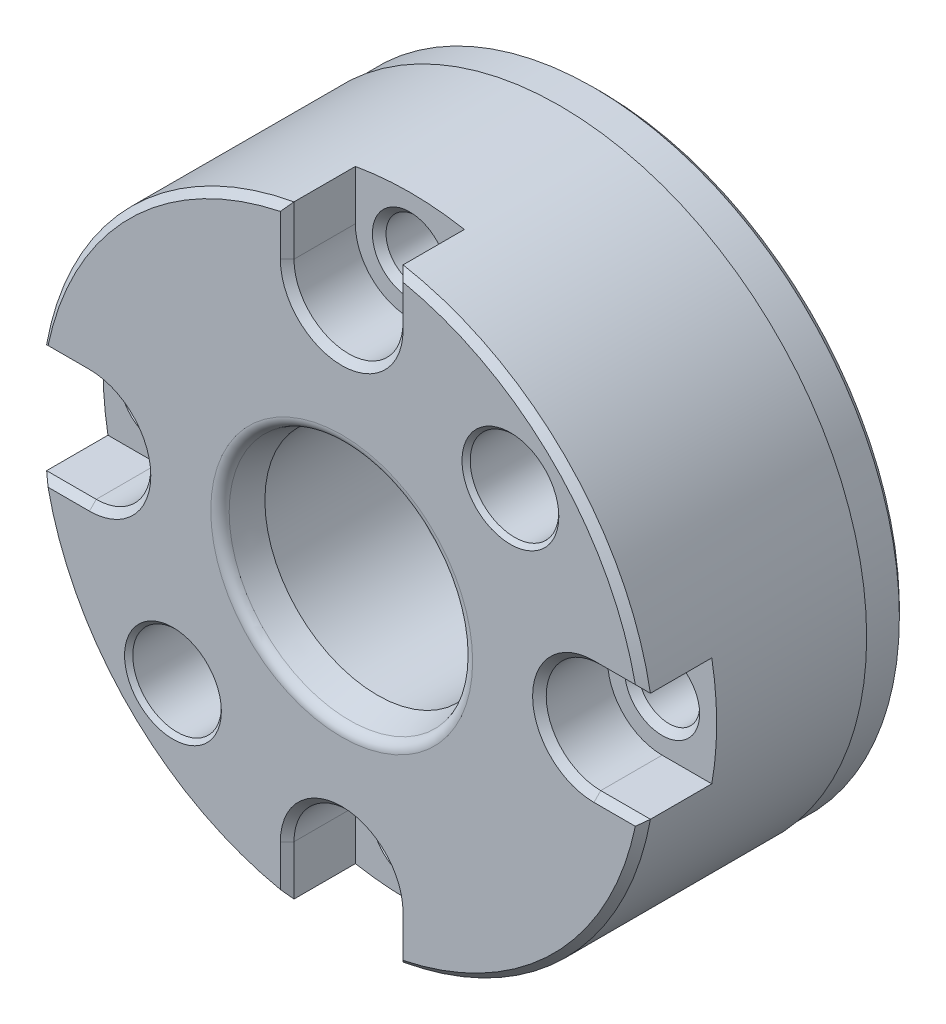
ISO-10303-21;
HEADER;
FILE_DESCRIPTION(('STEP AP214'),'2;1');
FILE_NAME('part.step','',(''),(''),'','','');
FILE_SCHEMA(('AUTOMOTIVE_DESIGN { 1 0 10303 214 1 1 1 1 }'));
ENDSEC;
DATA;
#1=APPLICATION_CONTEXT('core data for automotive mechanical design processes');
#2=APPLICATION_PROTOCOL_DEFINITION('international standard','automotive_design',2000,#1);
#3=PRODUCT_CONTEXT('',#1,'mechanical');
#4=PRODUCT('Part','Part','',(#3));
#5=PRODUCT_RELATED_PRODUCT_CATEGORY('part','',(#4));
#6=PRODUCT_DEFINITION_FORMATION('','',#4);
#7=PRODUCT_DEFINITION_CONTEXT('part definition',#1,'design');
#8=PRODUCT_DEFINITION('design','',#6,#7);
#9=PRODUCT_DEFINITION_SHAPE('','',#8);
#10=(LENGTH_UNIT() NAMED_UNIT(*) SI_UNIT(.MILLI.,.METRE.));
#11=(NAMED_UNIT(*) PLANE_ANGLE_UNIT() SI_UNIT($,.RADIAN.));
#12=(NAMED_UNIT(*) SI_UNIT($,.STERADIAN.) SOLID_ANGLE_UNIT());
#13=UNCERTAINTY_MEASURE_WITH_UNIT(LENGTH_MEASURE(1.E-05),#10,'distance_accuracy_value','');
#14=(GEOMETRIC_REPRESENTATION_CONTEXT(3) GLOBAL_UNCERTAINTY_ASSIGNED_CONTEXT((#13)) GLOBAL_UNIT_ASSIGNED_CONTEXT((#10,
#11,#12)) REPRESENTATION_CONTEXT('',''));
#15=CARTESIAN_POINT('',(0.,0.,0.));
#16=DIRECTION('',(0.,0.,1.));
#17=DIRECTION('',(1.,0.,0.));
#18=AXIS2_PLACEMENT_3D('',#15,#16,#17);
#19=CARTESIAN_POINT('',(-22.5,0.,19.));
#20=DIRECTION('',(0.,0.,1.));
#21=DIRECTION('',(1.,0.,0.));
#22=AXIS2_PLACEMENT_3D('',#19,#20,#21);
#23=PLANE('',#22);
#24=CARTESIAN_POINT('',(-12.3743686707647,-12.3743686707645,19.));
#25=DIRECTION('',(0.,0.,1.));
#26=DIRECTION('',(1.,0.,0.));
#27=AXIS2_PLACEMENT_3D('',#24,#25,#26);
#28=CIRCLE('',#27,3.55);
#29=CARTESIAN_POINT('',(-8.8243686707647,-12.3743686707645,19.));
#30=VERTEX_POINT('',#29);
#31=EDGE_CURVE('E749',#30,#30,#28,.F.);
#32=ORIENTED_EDGE('',*,*,#31,.T.);
#33=EDGE_LOOP('',(#32));
#34=FACE_BOUND('',#33,.T.);
#35=CARTESIAN_POINT('',(12.3743686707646,12.3743686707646,19.));
#36=DIRECTION('',(0.,0.,1.));
#37=DIRECTION('',(1.,0.,0.));
#38=AXIS2_PLACEMENT_3D('',#35,#36,#37);
#39=CIRCLE('',#38,3.55);
#40=CARTESIAN_POINT('',(15.9243686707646,12.3743686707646,19.));
#41=VERTEX_POINT('',#40);
#42=EDGE_CURVE('E746',#41,#41,#39,.F.);
#43=ORIENTED_EDGE('',*,*,#42,.T.);
#44=EDGE_LOOP('',(#43));
#45=FACE_BOUND('',#44,.T.);
#46=CARTESIAN_POINT('',(0.,0.,19.));
#47=DIRECTION('',(0.,0.,1.));
#48=DIRECTION('',(1.,0.,0.));
#49=AXIS2_PLACEMENT_3D('',#46,#47,#48);
#50=CIRCLE('',#49,9.60284324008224);
#51=CARTESIAN_POINT('',(9.60284324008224,0.,19.));
#52=VERTEX_POINT('',#51);
#53=EDGE_CURVE('E817',#52,#52,#50,.F.);
#54=ORIENTED_EDGE('',*,*,#53,.T.);
#55=EDGE_LOOP('',(#54));
#56=FACE_BOUND('',#55,.T.);
#57=DIRECTION('',(0.,1.,0.));
#58=VECTOR('',#57,1.);
#59=CARTESIAN_POINT('',(-4.50000000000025,22.1415898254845,19.));
#60=LINE('',#59,#58);
#61=CARTESIAN_POINT('',(-4.50000000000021,18.5,19.));
#62=VERTEX_POINT('',#61);
#63=CARTESIAN_POINT('',(-4.50000000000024,21.5348554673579,19.));
#64=VERTEX_POINT('',#63);
#65=EDGE_CURVE('E340',#62,#64,#60,.T.);
#66=ORIENTED_EDGE('',*,*,#65,.T.);
#67=CARTESIAN_POINT('',(0.,0.,19.));
#68=DIRECTION('',(0.,0.,1.));
#69=DIRECTION('',(1.,0.,0.));
#70=AXIS2_PLACEMENT_3D('',#67,#68,#69);
#71=CIRCLE('',#70,22.);
#72=CARTESIAN_POINT('',(-21.534855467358,4.5,19.));
#73=VERTEX_POINT('',#72);
#74=EDGE_CURVE('E366',#64,#73,#71,.T.);
#75=ORIENTED_EDGE('',*,*,#74,.T.);
#76=DIRECTION('',(1.,0.,0.));
#77=VECTOR('',#76,1.);
#78=CARTESIAN_POINT('',(-18.5,4.5,19.));
#79=LINE('',#78,#77);
#80=CARTESIAN_POINT('',(-18.5,4.5,19.));
#81=VERTEX_POINT('',#80);
#82=EDGE_CURVE('E364',#73,#81,#79,.T.);
#83=ORIENTED_EDGE('',*,*,#82,.T.);
#84=CARTESIAN_POINT('',(-18.5,0.,19.));
#85=DIRECTION('',(0.,0.,1.));
#86=DIRECTION('',(1.,0.,0.));
#87=AXIS2_PLACEMENT_3D('',#84,#85,#86);
#88=CIRCLE('',#87,4.5);
#89=CARTESIAN_POINT('',(-18.5,-4.5,19.));
#90=VERTEX_POINT('',#89);
#91=EDGE_CURVE('E362',#81,#90,#88,.F.);
#92=ORIENTED_EDGE('',*,*,#91,.T.);
#93=DIRECTION('',(-1.,0.,0.));
#94=VECTOR('',#93,1.);
#95=CARTESIAN_POINT('',(-22.1415898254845,-4.5,19.));
#96=LINE('',#95,#94);
#97=CARTESIAN_POINT('',(-21.534855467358,-4.5,19.));
#98=VERTEX_POINT('',#97);
#99=EDGE_CURVE('E360',#90,#98,#96,.T.);
#100=ORIENTED_EDGE('',*,*,#99,.T.);
#101=CARTESIAN_POINT('',(0.,0.,19.));
#102=DIRECTION('',(0.,0.,1.));
#103=DIRECTION('',(1.,0.,0.));
#104=AXIS2_PLACEMENT_3D('',#101,#102,#103);
#105=CIRCLE('',#104,22.);
#106=CARTESIAN_POINT('',(-4.49999999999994,-21.534855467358,19.));
#107=VERTEX_POINT('',#106);
#108=EDGE_CURVE('E358',#98,#107,#105,.T.);
#109=ORIENTED_EDGE('',*,*,#108,.T.);
#110=DIRECTION('',(0.,1.,0.));
#111=VECTOR('',#110,1.);
#112=CARTESIAN_POINT('',(-4.49999999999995,-18.5,19.));
#113=LINE('',#112,#111);
#114=CARTESIAN_POINT('',(-4.49999999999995,-18.5,19.));
#115=VERTEX_POINT('',#114);
#116=EDGE_CURVE('E356',#107,#115,#113,.T.);
#117=ORIENTED_EDGE('',*,*,#116,.T.);
#118=CARTESIAN_POINT('',(0.,-18.5,19.));
#119=DIRECTION('',(0.,0.,1.));
#120=DIRECTION('',(1.,0.,0.));
#121=AXIS2_PLACEMENT_3D('',#118,#119,#120);
#122=CIRCLE('',#121,4.5);
#123=CARTESIAN_POINT('',(4.50000000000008,-18.5,19.));
#124=VERTEX_POINT('',#123);
#125=EDGE_CURVE('E354',#115,#124,#122,.F.);
#126=ORIENTED_EDGE('',*,*,#125,.T.);
#127=DIRECTION('',(0.,-1.,0.));
#128=VECTOR('',#127,1.);
#129=CARTESIAN_POINT('',(4.5000000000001,-22.1415898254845,19.));
#130=LINE('',#129,#128);
#131=CARTESIAN_POINT('',(4.50000000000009,-21.534855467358,19.));
#132=VERTEX_POINT('',#131);
#133=EDGE_CURVE('E352',#124,#132,#130,.T.);
#134=ORIENTED_EDGE('',*,*,#133,.T.);
#135=CARTESIAN_POINT('',(0.,0.,19.));
#136=DIRECTION('',(0.,0.,1.));
#137=DIRECTION('',(1.,0.,0.));
#138=AXIS2_PLACEMENT_3D('',#135,#136,#137);
#139=CIRCLE('',#138,22.);
#140=CARTESIAN_POINT('',(21.534855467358,-4.49999999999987,19.));
#141=VERTEX_POINT('',#140);
#142=EDGE_CURVE('E350',#132,#141,#139,.T.);
#143=ORIENTED_EDGE('',*,*,#142,.T.);
#144=DIRECTION('',(-1.,0.,0.));
#145=VECTOR('',#144,1.);
#146=CARTESIAN_POINT('',(18.5,-4.49999999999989,19.));
#147=LINE('',#146,#145);
#148=CARTESIAN_POINT('',(18.5,-4.49999999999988,19.));
#149=VERTEX_POINT('',#148);
#150=EDGE_CURVE('E348',#141,#149,#147,.T.);
#151=ORIENTED_EDGE('',*,*,#150,.T.);
#152=CARTESIAN_POINT('',(18.5,1.31450406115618E-13,19.));
#153=DIRECTION('',(0.,0.,1.));
#154=DIRECTION('',(1.,0.,0.));
#155=AXIS2_PLACEMENT_3D('',#152,#153,#154);
#156=CIRCLE('',#155,4.5);
#157=CARTESIAN_POINT('',(18.5,4.50000000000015,19.));
#158=VERTEX_POINT('',#157);
#159=EDGE_CURVE('E346',#149,#158,#156,.F.);
#160=ORIENTED_EDGE('',*,*,#159,.T.);
#161=DIRECTION('',(1.,0.,0.));
#162=VECTOR('',#161,1.);
#163=CARTESIAN_POINT('',(22.1415898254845,4.50000000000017,19.));
#164=LINE('',#163,#162);
#165=CARTESIAN_POINT('',(21.5348554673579,4.50000000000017,19.));
#166=VERTEX_POINT('',#165);
#167=EDGE_CURVE('E344',#158,#166,#164,.T.);
#168=ORIENTED_EDGE('',*,*,#167,.T.);
#169=CARTESIAN_POINT('',(0.,0.,19.));
#170=DIRECTION('',(0.,0.,1.));
#171=DIRECTION('',(1.,0.,0.));
#172=AXIS2_PLACEMENT_3D('',#169,#170,#171);
#173=CIRCLE('',#172,22.);
#174=CARTESIAN_POINT('',(4.49999999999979,21.534855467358,19.));
#175=VERTEX_POINT('',#174);
#176=EDGE_CURVE('E342',#166,#175,#173,.T.);
#177=ORIENTED_EDGE('',*,*,#176,.T.);
#178=DIRECTION('',(0.,-1.,0.));
#179=VECTOR('',#178,1.);
#180=CARTESIAN_POINT('',(4.49999999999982,18.5,19.));
#181=LINE('',#180,#179);
#182=CARTESIAN_POINT('',(4.49999999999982,18.5,19.));
#183=VERTEX_POINT('',#182);
#184=EDGE_CURVE('E338',#175,#183,#181,.T.);
#185=ORIENTED_EDGE('',*,*,#184,.T.);
#186=CARTESIAN_POINT('',(-1.96042810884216E-13,18.5,19.));
#187=DIRECTION('',(0.,0.,1.));
#188=DIRECTION('',(1.,0.,0.));
#189=AXIS2_PLACEMENT_3D('',#186,#187,#188);
#190=CIRCLE('',#189,4.5);
#191=EDGE_CURVE('E336',#183,#62,#190,.F.);
#192=ORIENTED_EDGE('',*,*,#191,.T.);
#193=EDGE_LOOP('',(#66,#75,#83,#92,#100,#109,#117,#126,#134,#143,#151,#160,#168,#177,#185,#192));
#194=FACE_BOUND('',#193,.T.);
#195=ADVANCED_FACE('F14',(#34,#45,#56,#194),#23,.T.);
#196=CARTESIAN_POINT('',(0.,0.,0.));
#197=DIRECTION('',(0.,0.,-1.));
#198=DIRECTION('',(-1.,0.,0.));
#199=AXIS2_PLACEMENT_3D('',#196,#197,#198);
#200=CYLINDRICAL_SURFACE('',#199,22.5);
#201=CARTESIAN_POINT('',(0.,0.,3.));
#202=DIRECTION('',(0.,0.,-1.));
#203=DIRECTION('',(-1.,0.,0.));
#204=AXIS2_PLACEMENT_3D('',#201,#202,#203);
#205=CIRCLE('',#204,22.5);
#206=CARTESIAN_POINT('',(-22.5,0.,3.));
#207=VERTEX_POINT('',#206);
#208=EDGE_CURVE('E771',#207,#207,#205,.T.);
#209=ORIENTED_EDGE('',*,*,#208,.F.);
#210=EDGE_LOOP('',(#209));
#211=FACE_BOUND('',#210,.T.);
#212=DIRECTION('',(0.,0.,1.));
#213=VECTOR('',#212,1.);
#214=CARTESIAN_POINT('',(-22.1415898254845,4.,14.));
#215=LINE('',#214,#213);
#216=CARTESIAN_POINT('',(-22.1415898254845,4.,14.));
#217=VERTEX_POINT('',#216);
#218=CARTESIAN_POINT('',(-22.1415898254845,4.,18.5));
#219=VERTEX_POINT('',#218);
#220=EDGE_CURVE('E275',#217,#219,#215,.T.);
#221=ORIENTED_EDGE('',*,*,#220,.T.);
#222=CARTESIAN_POINT('',(0.,0.,18.5));
#223=DIRECTION('',(0.,0.,1.));
#224=DIRECTION('',(1.,0.,0.));
#225=AXIS2_PLACEMENT_3D('',#222,#223,#224);
#226=CIRCLE('',#225,22.5);
#227=CARTESIAN_POINT('',(-4.00000000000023,22.1415898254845,18.5));
#228=VERTEX_POINT('',#227);
#229=EDGE_CURVE('E333',#219,#228,#226,.F.);
#230=ORIENTED_EDGE('',*,*,#229,.T.);
#231=DIRECTION('',(0.,0.,1.));
#232=VECTOR('',#231,1.);
#233=CARTESIAN_POINT('',(-4.00000000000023,22.1415898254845,14.));
#234=LINE('',#233,#232);
#235=CARTESIAN_POINT('',(-4.00000000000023,22.1415898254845,14.));
#236=VERTEX_POINT('',#235);
#237=EDGE_CURVE('E211',#236,#228,#234,.T.);
#238=ORIENTED_EDGE('',*,*,#237,.F.);
#239=CARTESIAN_POINT('',(0.,0.,14.));
#240=DIRECTION('',(0.,0.,1.));
#241=DIRECTION('',(0.,-1.,0.));
#242=AXIS2_PLACEMENT_3D('',#239,#240,#241);
#243=CIRCLE('',#242,22.5);
#244=CARTESIAN_POINT('',(3.99999999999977,22.1415898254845,14.));
#245=VERTEX_POINT('',#244);
#246=EDGE_CURVE('E193',#245,#236,#243,.T.);
#247=ORIENTED_EDGE('',*,*,#246,.F.);
#248=DIRECTION('',(0.,0.,1.));
#249=VECTOR('',#248,1.);
#250=CARTESIAN_POINT('',(3.99999999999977,22.1415898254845,14.));
#251=LINE('',#250,#249);
#252=CARTESIAN_POINT('',(3.99999999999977,22.1415898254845,18.5));
#253=VERTEX_POINT('',#252);
#254=EDGE_CURVE('E184',#245,#253,#251,.T.);
#255=ORIENTED_EDGE('',*,*,#254,.T.);
#256=CARTESIAN_POINT('',(0.,0.,18.5));
#257=DIRECTION('',(0.,0.,1.));
#258=DIRECTION('',(1.,0.,0.));
#259=AXIS2_PLACEMENT_3D('',#256,#257,#258);
#260=CIRCLE('',#259,22.5);
#261=CARTESIAN_POINT('',(22.1415898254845,4.00000000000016,18.5));
#262=VERTEX_POINT('',#261);
#263=EDGE_CURVE('E327',#253,#262,#260,.F.);
#264=ORIENTED_EDGE('',*,*,#263,.T.);
#265=DIRECTION('',(0.,0.,1.));
#266=VECTOR('',#265,1.);
#267=CARTESIAN_POINT('',(22.1415898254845,4.00000000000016,14.));
#268=LINE('',#267,#266);
#269=CARTESIAN_POINT('',(22.1415898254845,4.00000000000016,14.));
#270=VERTEX_POINT('',#269);
#271=EDGE_CURVE('E228',#270,#262,#268,.T.);
#272=ORIENTED_EDGE('',*,*,#271,.F.);
#273=CARTESIAN_POINT('',(0.,0.,14.));
#274=DIRECTION('',(0.,0.,1.));
#275=DIRECTION('',(-1.,0.,0.));
#276=AXIS2_PLACEMENT_3D('',#273,#274,#275);
#277=CIRCLE('',#276,22.5);
#278=CARTESIAN_POINT('',(22.1415898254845,-3.99999999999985,14.));
#279=VERTEX_POINT('',#278);
#280=EDGE_CURVE('E218',#279,#270,#277,.T.);
#281=ORIENTED_EDGE('',*,*,#280,.F.);
#282=DIRECTION('',(0.,0.,1.));
#283=VECTOR('',#282,1.);
#284=CARTESIAN_POINT('',(22.1415898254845,-3.99999999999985,14.));
#285=LINE('',#284,#283);
#286=CARTESIAN_POINT('',(22.1415898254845,-3.99999999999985,18.5));
#287=VERTEX_POINT('',#286);
#288=EDGE_CURVE('E231',#279,#287,#285,.T.);
#289=ORIENTED_EDGE('',*,*,#288,.T.);
#290=CARTESIAN_POINT('',(0.,0.,18.5));
#291=DIRECTION('',(0.,0.,1.));
#292=DIRECTION('',(1.,0.,0.));
#293=AXIS2_PLACEMENT_3D('',#290,#291,#292);
#294=CIRCLE('',#293,22.5);
#295=CARTESIAN_POINT('',(4.00000000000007,-22.1415898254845,18.5));
#296=VERTEX_POINT('',#295);
#297=EDGE_CURVE('E329',#287,#296,#294,.F.);
#298=ORIENTED_EDGE('',*,*,#297,.T.);
#299=DIRECTION('',(0.,0.,1.));
#300=VECTOR('',#299,1.);
#301=CARTESIAN_POINT('',(4.00000000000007,-22.1415898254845,14.));
#302=LINE('',#301,#300);
#303=CARTESIAN_POINT('',(4.00000000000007,-22.1415898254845,14.));
#304=VERTEX_POINT('',#303);
#305=EDGE_CURVE('E250',#304,#296,#302,.T.);
#306=ORIENTED_EDGE('',*,*,#305,.F.);
#307=CARTESIAN_POINT('',(0.,0.,14.));
#308=DIRECTION('',(0.,0.,1.));
#309=DIRECTION('',(0.,1.,0.));
#310=AXIS2_PLACEMENT_3D('',#307,#308,#309);
#311=CIRCLE('',#310,22.5);
#312=CARTESIAN_POINT('',(-3.99999999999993,-22.1415898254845,14.));
#313=VERTEX_POINT('',#312);
#314=EDGE_CURVE('E240',#313,#304,#311,.T.);
#315=ORIENTED_EDGE('',*,*,#314,.F.);
#316=DIRECTION('',(0.,0.,1.));
#317=VECTOR('',#316,1.);
#318=CARTESIAN_POINT('',(-3.99999999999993,-22.1415898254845,14.));
#319=LINE('',#318,#317);
#320=CARTESIAN_POINT('',(-3.99999999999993,-22.1415898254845,18.5));
#321=VERTEX_POINT('',#320);
#322=EDGE_CURVE('E253',#313,#321,#319,.T.);
#323=ORIENTED_EDGE('',*,*,#322,.T.);
#324=CARTESIAN_POINT('',(0.,0.,18.5));
#325=DIRECTION('',(0.,0.,1.));
#326=DIRECTION('',(1.,0.,0.));
#327=AXIS2_PLACEMENT_3D('',#324,#325,#326);
#328=CIRCLE('',#327,22.5);
#329=CARTESIAN_POINT('',(-22.1415898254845,-4.,18.5));
#330=VERTEX_POINT('',#329);
#331=EDGE_CURVE('E331',#321,#330,#328,.F.);
#332=ORIENTED_EDGE('',*,*,#331,.T.);
#333=DIRECTION('',(0.,0.,1.));
#334=VECTOR('',#333,1.);
#335=CARTESIAN_POINT('',(-22.1415898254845,-4.,14.));
#336=LINE('',#335,#334);
#337=CARTESIAN_POINT('',(-22.1415898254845,-4.,14.));
#338=VERTEX_POINT('',#337);
#339=EDGE_CURVE('E272',#338,#330,#336,.T.);
#340=ORIENTED_EDGE('',*,*,#339,.F.);
#341=CARTESIAN_POINT('',(0.,0.,14.));
#342=DIRECTION('',(0.,0.,1.));
#343=DIRECTION('',(1.,0.,0.));
#344=AXIS2_PLACEMENT_3D('',#341,#342,#343);
#345=CIRCLE('',#344,22.5);
#346=EDGE_CURVE('E262',#217,#338,#345,.T.);
#347=ORIENTED_EDGE('',*,*,#346,.F.);
#348=EDGE_LOOP('',(#221,#230,#238,#247,#255,#264,#272,#281,#289,#298,#306,#315,#323,#332,#340,#347));
#349=FACE_BOUND('',#348,.T.);
#350=ADVANCED_FACE('F567',(#211,#349),#200,.T.);
#351=CARTESIAN_POINT('',(-22.5,0.,0.));
#352=DIRECTION('',(0.,0.,-1.));
#353=DIRECTION('',(-1.,0.,0.));
#354=AXIS2_PLACEMENT_3D('',#351,#352,#353);
#355=PLANE('',#354);
#356=CARTESIAN_POINT('',(0.,0.,0.));
#357=DIRECTION('',(0.,0.,-1.));
#358=DIRECTION('',(-1.,0.,0.));
#359=AXIS2_PLACEMENT_3D('',#356,#357,#358);
#360=CIRCLE('',#359,21.9);
#361=CARTESIAN_POINT('',(-21.9,0.,0.));
#362=VERTEX_POINT('',#361);
#363=EDGE_CURVE('E23',#362,#362,#360,.T.);
#364=ORIENTED_EDGE('',*,*,#363,.T.);
#365=EDGE_LOOP('',(#364));
#366=FACE_BOUND('',#365,.T.);
#367=CARTESIAN_POINT('',(12.3743686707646,12.3743686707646,0.));
#368=DIRECTION('',(0.,0.,1.));
#369=DIRECTION('',(1.,0.,0.));
#370=AXIS2_PLACEMENT_3D('',#367,#368,#369);
#371=CIRCLE('',#370,3.5);
#372=CARTESIAN_POINT('',(15.8743686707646,12.3743686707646,0.));
#373=VERTEX_POINT('',#372);
#374=EDGE_CURVE('E710',#373,#373,#371,.T.);
#375=ORIENTED_EDGE('',*,*,#374,.T.);
#376=EDGE_LOOP('',(#375));
#377=FACE_BOUND('',#376,.T.);
#378=CARTESIAN_POINT('',(-12.3743686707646,-12.3743686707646,0.));
#379=DIRECTION('',(0.,0.,1.));
#380=DIRECTION('',(1.,0.,0.));
#381=AXIS2_PLACEMENT_3D('',#378,#379,#380);
#382=CIRCLE('',#381,3.5);
#383=CARTESIAN_POINT('',(-8.8743686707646,-12.3743686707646,0.));
#384=VERTEX_POINT('',#383);
#385=EDGE_CURVE('E714',#384,#384,#382,.T.);
#386=ORIENTED_EDGE('',*,*,#385,.T.);
#387=EDGE_LOOP('',(#386));
#388=FACE_BOUND('',#387,.T.);
#389=CARTESIAN_POINT('',(0.,0.,0.));
#390=DIRECTION('',(0.,0.,-1.));
#391=DIRECTION('',(-1.,0.,0.));
#392=AXIS2_PLACEMENT_3D('',#389,#390,#391);
#393=CIRCLE('',#392,9.06111367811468);
#394=CARTESIAN_POINT('',(-9.06111367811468,0.,0.));
#395=VERTEX_POINT('',#394);
#396=EDGE_CURVE('E718',#395,#395,#393,.F.);
#397=ORIENTED_EDGE('',*,*,#396,.T.);
#398=EDGE_LOOP('',(#397));
#399=FACE_BOUND('',#398,.T.);
#400=CARTESIAN_POINT('',(-1.96042810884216E-13,18.5,0.));
#401=DIRECTION('',(0.,0.,-1.));
#402=DIRECTION('',(-1.,0.,0.));
#403=AXIS2_PLACEMENT_3D('',#400,#401,#402);
#404=CIRCLE('',#403,2.75);
#405=CARTESIAN_POINT('',(-2.7500000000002,18.5,0.));
#406=VERTEX_POINT('',#405);
#407=EDGE_CURVE('E315',#406,#406,#404,.F.);
#408=ORIENTED_EDGE('',*,*,#407,.T.);
#409=EDGE_LOOP('',(#408));
#410=FACE_BOUND('',#409,.T.);
#411=CARTESIAN_POINT('',(18.5,1.31450406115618E-13,0.));
#412=DIRECTION('',(0.,0.,-1.));
#413=DIRECTION('',(-1.,0.,0.));
#414=AXIS2_PLACEMENT_3D('',#411,#412,#413);
#415=CIRCLE('',#414,2.75);
#416=CARTESIAN_POINT('',(15.75,1.31450406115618E-13,0.));
#417=VERTEX_POINT('',#416);
#418=EDGE_CURVE('E303',#417,#417,#415,.F.);
#419=ORIENTED_EDGE('',*,*,#418,.T.);
#420=EDGE_LOOP('',(#419));
#421=FACE_BOUND('',#420,.T.);
#422=CARTESIAN_POINT('',(0.,-18.5,0.));
#423=DIRECTION('',(0.,0.,-1.));
#424=DIRECTION('',(-1.,0.,0.));
#425=AXIS2_PLACEMENT_3D('',#422,#423,#424);
#426=CIRCLE('',#425,2.75);
#427=CARTESIAN_POINT('',(-2.74999999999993,-18.5,0.));
#428=VERTEX_POINT('',#427);
#429=EDGE_CURVE('E291',#428,#428,#426,.F.);
#430=ORIENTED_EDGE('',*,*,#429,.T.);
#431=EDGE_LOOP('',(#430));
#432=FACE_BOUND('',#431,.T.);
#433=CARTESIAN_POINT('',(-18.5,0.,0.));
#434=DIRECTION('',(0.,0.,-1.));
#435=DIRECTION('',(-1.,0.,0.));
#436=AXIS2_PLACEMENT_3D('',#433,#434,#435);
#437=CIRCLE('',#436,2.75);
#438=CARTESIAN_POINT('',(-21.25,0.,0.));
#439=VERTEX_POINT('',#438);
#440=EDGE_CURVE('E271',#439,#439,#437,.F.);
#441=ORIENTED_EDGE('',*,*,#440,.T.);
#442=EDGE_LOOP('',(#441));
#443=FACE_BOUND('',#442,.T.);
#444=ADVANCED_FACE('F573',(#366,#377,#388,#399,#410,#421,#432,#443),#355,.T.);
#445=CARTESIAN_POINT('',(0.,0.,6.2));
#446=DIRECTION('',(0.,0.,1.));
#447=DIRECTION('',(1.,0.,0.));
#448=AXIS2_PLACEMENT_3D('',#445,#446,#447);
#449=PLANE('',#448);
#450=CARTESIAN_POINT('',(0.,0.,6.2));
#451=DIRECTION('',(0.,0.,1.));
#452=DIRECTION('',(1.,0.,0.));
#453=AXIS2_PLACEMENT_3D('',#450,#451,#452);
#454=CIRCLE('',#453,7.85);
#455=CARTESIAN_POINT('',(7.85,0.,6.2));
#456=VERTEX_POINT('',#455);
#457=EDGE_CURVE('E814',#456,#456,#454,.T.);
#458=ORIENTED_EDGE('',*,*,#457,.T.);
#459=EDGE_LOOP('',(#458));
#460=FACE_BOUND('',#459,.T.);
#461=CARTESIAN_POINT('',(0.,0.,6.2));
#462=DIRECTION('',(0.,0.,1.));
#463=DIRECTION('',(1.,0.,0.));
#464=AXIS2_PLACEMENT_3D('',#461,#462,#463);
#465=CIRCLE('',#464,7.);
#466=CARTESIAN_POINT('',(7.,0.,6.2));
#467=VERTEX_POINT('',#466);
#468=EDGE_CURVE('E808',#467,#467,#465,.F.);
#469=ORIENTED_EDGE('',*,*,#468,.T.);
#470=EDGE_LOOP('',(#469));
#471=FACE_BOUND('',#470,.T.);
#472=ADVANCED_FACE('F696',(#460,#471),#449,.T.);
#473=CARTESIAN_POINT('',(-18.5,0.,14.));
#474=DIRECTION('',(0.,0.,1.));
#475=DIRECTION('',(1.,0.,0.));
#476=AXIS2_PLACEMENT_3D('',#473,#474,#475);
#477=CYLINDRICAL_SURFACE('',#476,4.);
#478=DIRECTION('',(0.,0.,1.));
#479=VECTOR('',#478,1.);
#480=CARTESIAN_POINT('',(-18.5,-4.,14.));
#481=LINE('',#480,#479);
#482=CARTESIAN_POINT('',(-18.5,-4.,14.));
#483=VERTEX_POINT('',#482);
#484=CARTESIAN_POINT('',(-18.5,-4.,18.5));
#485=VERTEX_POINT('',#484);
#486=EDGE_CURVE('E268',#483,#485,#481,.T.);
#487=ORIENTED_EDGE('',*,*,#486,.T.);
#488=CARTESIAN_POINT('',(-18.5,0.,18.5));
#489=DIRECTION('',(0.,0.,1.));
#490=DIRECTION('',(1.,0.,0.));
#491=AXIS2_PLACEMENT_3D('',#488,#489,#490);
#492=CIRCLE('',#491,4.);
#493=CARTESIAN_POINT('',(-18.5,4.,18.5));
#494=VERTEX_POINT('',#493);
#495=EDGE_CURVE('E371',#485,#494,#492,.T.);
#496=ORIENTED_EDGE('',*,*,#495,.T.);
#497=DIRECTION('',(0.,0.,1.));
#498=VECTOR('',#497,1.);
#499=CARTESIAN_POINT('',(-18.5,4.,14.));
#500=LINE('',#499,#498);
#501=CARTESIAN_POINT('',(-18.5,4.,14.));
#502=VERTEX_POINT('',#501);
#503=EDGE_CURVE('E267',#502,#494,#500,.T.);
#504=ORIENTED_EDGE('',*,*,#503,.F.);
#505=CARTESIAN_POINT('',(-18.5,0.,14.));
#506=DIRECTION('',(0.,0.,1.));
#507=DIRECTION('',(1.,0.,0.));
#508=AXIS2_PLACEMENT_3D('',#505,#506,#507);
#509=CIRCLE('',#508,4.);
#510=EDGE_CURVE('E249',#483,#502,#509,.T.);
#511=ORIENTED_EDGE('',*,*,#510,.F.);
#512=EDGE_LOOP('',(#487,#496,#504,#511));
#513=FACE_BOUND('',#512,.T.);
#514=ADVANCED_FACE('F689',(#513),#477,.F.);
#515=CARTESIAN_POINT('',(-18.5,-4.,14.));
#516=DIRECTION('',(0.,-1.,0.));
#517=DIRECTION('',(0.,0.,-1.));
#518=AXIS2_PLACEMENT_3D('',#515,#516,#517);
#519=PLANE('',#518);
#520=ORIENTED_EDGE('',*,*,#339,.T.);
#521=DIRECTION('',(1.,0.,0.));
#522=VECTOR('',#521,1.);
#523=CARTESIAN_POINT('',(-18.5,-4.,18.5));
#524=LINE('',#523,#522);
#525=EDGE_CURVE('E373',#330,#485,#524,.T.);
#526=ORIENTED_EDGE('',*,*,#525,.T.);
#527=ORIENTED_EDGE('',*,*,#486,.F.);
#528=DIRECTION('',(1.,0.,0.));
#529=VECTOR('',#528,1.);
#530=CARTESIAN_POINT('',(-18.5,-4.,14.));
#531=LINE('',#530,#529);
#532=EDGE_CURVE('E264',#338,#483,#531,.T.);
#533=ORIENTED_EDGE('',*,*,#532,.F.);
#534=EDGE_LOOP('',(#520,#526,#527,#533));
#535=FACE_BOUND('',#534,.T.);
#536=ADVANCED_FACE('F686',(#535),#519,.F.);
#537=CARTESIAN_POINT('',(-18.5,4.,14.));
#538=DIRECTION('',(0.,1.,0.));
#539=DIRECTION('',(0.,0.,1.));
#540=AXIS2_PLACEMENT_3D('',#537,#538,#539);
#541=PLANE('',#540);
#542=ORIENTED_EDGE('',*,*,#503,.T.);
#543=DIRECTION('',(-1.,0.,0.));
#544=VECTOR('',#543,1.);
#545=CARTESIAN_POINT('',(-22.1415898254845,4.,18.5));
#546=LINE('',#545,#544);
#547=EDGE_CURVE('E369',#494,#219,#546,.T.);
#548=ORIENTED_EDGE('',*,*,#547,.T.);
#549=ORIENTED_EDGE('',*,*,#220,.F.);
#550=DIRECTION('',(-1.,0.,0.));
#551=VECTOR('',#550,1.);
#552=CARTESIAN_POINT('',(-18.5,4.,14.));
#553=LINE('',#552,#551);
#554=EDGE_CURVE('E260',#502,#217,#553,.T.);
#555=ORIENTED_EDGE('',*,*,#554,.F.);
#556=EDGE_LOOP('',(#542,#548,#549,#555));
#557=FACE_BOUND('',#556,.T.);
#558=ADVANCED_FACE('F684',(#557),#541,.F.);
#559=CARTESIAN_POINT('',(-18.5,0.,14.));
#560=DIRECTION('',(0.,0.,1.));
#561=DIRECTION('',(1.,0.,0.));
#562=AXIS2_PLACEMENT_3D('',#559,#560,#561);
#563=PLANE('',#562);
#564=CARTESIAN_POINT('',(-18.5,0.,14.));
#565=DIRECTION('',(0.,0.,1.));
#566=DIRECTION('',(1.,0.,0.));
#567=AXIS2_PLACEMENT_3D('',#564,#565,#566);
#568=CIRCLE('',#567,2.75);
#569=CARTESIAN_POINT('',(-15.75,0.,14.));
#570=VERTEX_POINT('',#569);
#571=EDGE_CURVE('E288',#570,#570,#568,.F.);
#572=ORIENTED_EDGE('',*,*,#571,.T.);
#573=EDGE_LOOP('',(#572));
#574=FACE_BOUND('',#573,.T.);
#575=ORIENTED_EDGE('',*,*,#510,.T.);
#576=ORIENTED_EDGE('',*,*,#554,.T.);
#577=ORIENTED_EDGE('',*,*,#346,.T.);
#578=ORIENTED_EDGE('',*,*,#532,.T.);
#579=EDGE_LOOP('',(#575,#576,#577,#578));
#580=FACE_BOUND('',#579,.T.);
#581=ADVANCED_FACE('F680',(#574,#580),#563,.T.);
#582=CARTESIAN_POINT('',(-18.5,0.,0.));
#583=DIRECTION('',(0.,0.,1.));
#584=DIRECTION('',(1.,0.,0.));
#585=AXIS2_PLACEMENT_3D('',#582,#583,#584);
#586=CYLINDRICAL_SURFACE('',#585,2.25);
#587=CARTESIAN_POINT('',(-18.5,0.,0.499999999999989));
#588=DIRECTION('',(0.,0.,-1.));
#589=DIRECTION('',(-1.,0.,0.));
#590=AXIS2_PLACEMENT_3D('',#587,#588,#589);
#591=CIRCLE('',#590,2.25);
#592=CARTESIAN_POINT('',(-20.75,0.,0.499999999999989));
#593=VERTEX_POINT('',#592);
#594=EDGE_CURVE('E285',#593,#593,#591,.T.);
#595=ORIENTED_EDGE('',*,*,#594,.T.);
#596=EDGE_LOOP('',(#595));
#597=FACE_BOUND('',#596,.T.);
#598=CARTESIAN_POINT('',(-18.5,0.,13.5));
#599=DIRECTION('',(0.,0.,1.));
#600=DIRECTION('',(1.,0.,0.));
#601=AXIS2_PLACEMENT_3D('',#598,#599,#600);
#602=CIRCLE('',#601,2.25);
#603=CARTESIAN_POINT('',(-16.25,0.,13.5));
#604=VERTEX_POINT('',#603);
#605=EDGE_CURVE('E282',#604,#604,#602,.T.);
#606=ORIENTED_EDGE('',*,*,#605,.T.);
#607=EDGE_LOOP('',(#606));
#608=FACE_BOUND('',#607,.T.);
#609=ADVANCED_FACE('F584',(#597,#608),#586,.F.);
#610=CARTESIAN_POINT('',(-18.5,0.,0.));
#611=DIRECTION('',(0.,0.,-1.));
#612=DIRECTION('',(-1.,0.,0.));
#613=AXIS2_PLACEMENT_3D('',#610,#611,#612);
#614=CONICAL_SURFACE('',#613,2.75,0.785398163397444);
#615=ORIENTED_EDGE('',*,*,#594,.F.);
#616=EDGE_LOOP('',(#615));
#617=FACE_BOUND('',#616,.T.);
#618=ORIENTED_EDGE('',*,*,#440,.F.);
#619=EDGE_LOOP('',(#618));
#620=FACE_BOUND('',#619,.T.);
#621=ADVANCED_FACE('F580',(#617,#620),#614,.F.);
#622=CARTESIAN_POINT('',(-18.5,0.,13.5));
#623=DIRECTION('',(0.,0.,1.));
#624=DIRECTION('',(1.,0.,0.));
#625=AXIS2_PLACEMENT_3D('',#622,#623,#624);
#626=CONICAL_SURFACE('',#625,2.25,0.785398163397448);
#627=ORIENTED_EDGE('',*,*,#571,.F.);
#628=EDGE_LOOP('',(#627));
#629=FACE_BOUND('',#628,.T.);
#630=ORIENTED_EDGE('',*,*,#605,.F.);
#631=EDGE_LOOP('',(#630));
#632=FACE_BOUND('',#631,.T.);
#633=ADVANCED_FACE('F583',(#629,#632),#626,.F.);
#634=CARTESIAN_POINT('',(0.,-18.5,14.));
#635=DIRECTION('',(0.,0.,1.));
#636=DIRECTION('',(1.,0.,0.));
#637=AXIS2_PLACEMENT_3D('',#634,#635,#636);
#638=CYLINDRICAL_SURFACE('',#637,4.);
#639=DIRECTION('',(0.,0.,1.));
#640=VECTOR('',#639,1.);
#641=CARTESIAN_POINT('',(4.00000000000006,-18.5,14.));
#642=LINE('',#641,#640);
#643=CARTESIAN_POINT('',(4.00000000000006,-18.5,14.));
#644=VERTEX_POINT('',#643);
#645=CARTESIAN_POINT('',(4.00000000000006,-18.5,18.5));
#646=VERTEX_POINT('',#645);
#647=EDGE_CURVE('E246',#644,#646,#642,.T.);
#648=ORIENTED_EDGE('',*,*,#647,.T.);
#649=CARTESIAN_POINT('',(0.,-18.5,18.5));
#650=DIRECTION('',(0.,0.,1.));
#651=DIRECTION('',(1.,0.,0.));
#652=AXIS2_PLACEMENT_3D('',#649,#650,#651);
#653=CIRCLE('',#652,4.);
#654=CARTESIAN_POINT('',(-3.99999999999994,-18.5,18.5));
#655=VERTEX_POINT('',#654);
#656=EDGE_CURVE('E377',#646,#655,#653,.T.);
#657=ORIENTED_EDGE('',*,*,#656,.T.);
#658=DIRECTION('',(0.,0.,1.));
#659=VECTOR('',#658,1.);
#660=CARTESIAN_POINT('',(-3.99999999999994,-18.5,14.));
#661=LINE('',#660,#659);
#662=CARTESIAN_POINT('',(-3.99999999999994,-18.5,14.));
#663=VERTEX_POINT('',#662);
#664=EDGE_CURVE('E245',#663,#655,#661,.T.);
#665=ORIENTED_EDGE('',*,*,#664,.F.);
#666=CARTESIAN_POINT('',(0.,-18.5,14.));
#667=DIRECTION('',(0.,0.,1.));
#668=DIRECTION('',(0.,1.,0.));
#669=AXIS2_PLACEMENT_3D('',#666,#667,#668);
#670=CIRCLE('',#669,4.);
#671=EDGE_CURVE('E227',#644,#663,#670,.T.);
#672=ORIENTED_EDGE('',*,*,#671,.F.);
#673=EDGE_LOOP('',(#648,#657,#665,#672));
#674=FACE_BOUND('',#673,.T.);
#675=ADVANCED_FACE('F588',(#674),#638,.F.);
#676=CARTESIAN_POINT('',(4.00000000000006,-18.5,14.));
#677=DIRECTION('',(1.,0.,0.));
#678=DIRECTION('',(0.,1.,0.));
#679=AXIS2_PLACEMENT_3D('',#676,#677,#678);
#680=PLANE('',#679);
#681=ORIENTED_EDGE('',*,*,#305,.T.);
#682=DIRECTION('',(0.,1.,0.));
#683=VECTOR('',#682,1.);
#684=CARTESIAN_POINT('',(4.00000000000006,-18.5,18.5));
#685=LINE('',#684,#683);
#686=EDGE_CURVE('E379',#296,#646,#685,.T.);
#687=ORIENTED_EDGE('',*,*,#686,.T.);
#688=ORIENTED_EDGE('',*,*,#647,.F.);
#689=DIRECTION('',(0.,1.,0.));
#690=VECTOR('',#689,1.);
#691=CARTESIAN_POINT('',(4.00000000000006,-18.5,14.));
#692=LINE('',#691,#690);
#693=EDGE_CURVE('E242',#304,#644,#692,.T.);
#694=ORIENTED_EDGE('',*,*,#693,.F.);
#695=EDGE_LOOP('',(#681,#687,#688,#694));
#696=FACE_BOUND('',#695,.T.);
#697=ADVANCED_FACE('F668',(#696),#680,.F.);
#698=CARTESIAN_POINT('',(-3.99999999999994,-18.5,14.));
#699=DIRECTION('',(-1.,0.,0.));
#700=DIRECTION('',(0.,-1.,0.));
#701=AXIS2_PLACEMENT_3D('',#698,#699,#700);
#702=PLANE('',#701);
#703=ORIENTED_EDGE('',*,*,#664,.T.);
#704=DIRECTION('',(0.,-1.,0.));
#705=VECTOR('',#704,1.);
#706=CARTESIAN_POINT('',(-3.99999999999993,-22.1415898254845,18.5));
#707=LINE('',#706,#705);
#708=EDGE_CURVE('E375',#655,#321,#707,.T.);
#709=ORIENTED_EDGE('',*,*,#708,.T.);
#710=ORIENTED_EDGE('',*,*,#322,.F.);
#711=DIRECTION('',(0.,-1.,0.));
#712=VECTOR('',#711,1.);
#713=CARTESIAN_POINT('',(-3.99999999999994,-18.5,14.));
#714=LINE('',#713,#712);
#715=EDGE_CURVE('E238',#663,#313,#714,.T.);
#716=ORIENTED_EDGE('',*,*,#715,.F.);
#717=EDGE_LOOP('',(#703,#709,#710,#716));
#718=FACE_BOUND('',#717,.T.);
#719=ADVANCED_FACE('F666',(#718),#702,.F.);
#720=CARTESIAN_POINT('',(0.,-18.5,14.));
#721=DIRECTION('',(0.,0.,1.));
#722=DIRECTION('',(0.,1.,0.));
#723=AXIS2_PLACEMENT_3D('',#720,#721,#722);
#724=PLANE('',#723);
#725=CARTESIAN_POINT('',(0.,-18.5,14.));
#726=DIRECTION('',(0.,0.,1.));
#727=DIRECTION('',(1.,0.,0.));
#728=AXIS2_PLACEMENT_3D('',#725,#726,#727);
#729=CIRCLE('',#728,2.75);
#730=CARTESIAN_POINT('',(2.75000000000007,-18.5,14.));
#731=VERTEX_POINT('',#730);
#732=EDGE_CURVE('E300',#731,#731,#729,.F.);
#733=ORIENTED_EDGE('',*,*,#732,.T.);
#734=EDGE_LOOP('',(#733));
#735=FACE_BOUND('',#734,.T.);
#736=ORIENTED_EDGE('',*,*,#671,.T.);
#737=ORIENTED_EDGE('',*,*,#715,.T.);
#738=ORIENTED_EDGE('',*,*,#314,.T.);
#739=ORIENTED_EDGE('',*,*,#693,.T.);
#740=EDGE_LOOP('',(#736,#737,#738,#739));
#741=FACE_BOUND('',#740,.T.);
#742=ADVANCED_FACE('F662',(#735,#741),#724,.T.);
#743=CARTESIAN_POINT('',(18.5,1.31450406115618E-13,14.));
#744=DIRECTION('',(0.,0.,1.));
#745=DIRECTION('',(1.,0.,0.));
#746=AXIS2_PLACEMENT_3D('',#743,#744,#745);
#747=CYLINDRICAL_SURFACE('',#746,4.);
#748=DIRECTION('',(0.,0.,1.));
#749=VECTOR('',#748,1.);
#750=CARTESIAN_POINT('',(18.5,4.00000000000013,14.));
#751=LINE('',#750,#749);
#752=CARTESIAN_POINT('',(18.5,4.00000000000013,14.));
#753=VERTEX_POINT('',#752);
#754=CARTESIAN_POINT('',(18.5,4.00000000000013,18.5));
#755=VERTEX_POINT('',#754);
#756=EDGE_CURVE('E224',#753,#755,#751,.T.);
#757=ORIENTED_EDGE('',*,*,#756,.T.);
#758=CARTESIAN_POINT('',(18.5,1.31450406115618E-13,18.5));
#759=DIRECTION('',(0.,0.,1.));
#760=DIRECTION('',(1.,0.,0.));
#761=AXIS2_PLACEMENT_3D('',#758,#759,#760);
#762=CIRCLE('',#761,4.);
#763=CARTESIAN_POINT('',(18.5,-3.99999999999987,18.5));
#764=VERTEX_POINT('',#763);
#765=EDGE_CURVE('E383',#755,#764,#762,.T.);
#766=ORIENTED_EDGE('',*,*,#765,.T.);
#767=DIRECTION('',(0.,0.,1.));
#768=VECTOR('',#767,1.);
#769=CARTESIAN_POINT('',(18.5,-3.99999999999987,14.));
#770=LINE('',#769,#768);
#771=CARTESIAN_POINT('',(18.5,-3.99999999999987,14.));
#772=VERTEX_POINT('',#771);
#773=EDGE_CURVE('E223',#772,#764,#770,.T.);
#774=ORIENTED_EDGE('',*,*,#773,.F.);
#775=CARTESIAN_POINT('',(18.5,1.31450406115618E-13,14.));
#776=DIRECTION('',(0.,0.,1.));
#777=DIRECTION('',(-1.,0.,0.));
#778=AXIS2_PLACEMENT_3D('',#775,#776,#777);
#779=CIRCLE('',#778,4.);
#780=EDGE_CURVE('E210',#753,#772,#779,.T.);
#781=ORIENTED_EDGE('',*,*,#780,.F.);
#782=EDGE_LOOP('',(#757,#766,#774,#781));
#783=FACE_BOUND('',#782,.T.);
#784=ADVANCED_FACE('F655',(#783),#747,.F.);
#785=CARTESIAN_POINT('',(18.5,4.00000000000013,14.));
#786=DIRECTION('',(0.,1.,0.));
#787=DIRECTION('',(-1.,0.,0.));
#788=AXIS2_PLACEMENT_3D('',#785,#786,#787);
#789=PLANE('',#788);
#790=ORIENTED_EDGE('',*,*,#271,.T.);
#791=DIRECTION('',(-1.,0.,0.));
#792=VECTOR('',#791,1.);
#793=CARTESIAN_POINT('',(18.5,4.00000000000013,18.5));
#794=LINE('',#793,#792);
#795=EDGE_CURVE('E385',#262,#755,#794,.T.);
#796=ORIENTED_EDGE('',*,*,#795,.T.);
#797=ORIENTED_EDGE('',*,*,#756,.F.);
#798=DIRECTION('',(-1.,0.,0.));
#799=VECTOR('',#798,1.);
#800=CARTESIAN_POINT('',(18.5,4.00000000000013,14.));
#801=LINE('',#800,#799);
#802=EDGE_CURVE('E220',#270,#753,#801,.T.);
#803=ORIENTED_EDGE('',*,*,#802,.F.);
#804=EDGE_LOOP('',(#790,#796,#797,#803));
#805=FACE_BOUND('',#804,.T.);
#806=ADVANCED_FACE('F652',(#805),#789,.F.);
#807=CARTESIAN_POINT('',(18.5,-3.99999999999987,14.));
#808=DIRECTION('',(0.,-1.,0.));
#809=DIRECTION('',(1.,0.,0.));
#810=AXIS2_PLACEMENT_3D('',#807,#808,#809);
#811=PLANE('',#810);
#812=ORIENTED_EDGE('',*,*,#773,.T.);
#813=DIRECTION('',(1.,0.,0.));
#814=VECTOR('',#813,1.);
#815=CARTESIAN_POINT('',(22.1415898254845,-3.99999999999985,18.5));
#816=LINE('',#815,#814);
#817=EDGE_CURVE('E381',#764,#287,#816,.T.);
#818=ORIENTED_EDGE('',*,*,#817,.T.);
#819=ORIENTED_EDGE('',*,*,#288,.F.);
#820=DIRECTION('',(1.,0.,0.));
#821=VECTOR('',#820,1.);
#822=CARTESIAN_POINT('',(18.5,-3.99999999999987,14.));
#823=LINE('',#822,#821);
#824=EDGE_CURVE('E216',#772,#279,#823,.T.);
#825=ORIENTED_EDGE('',*,*,#824,.F.);
#826=EDGE_LOOP('',(#812,#818,#819,#825));
#827=FACE_BOUND('',#826,.T.);
#828=ADVANCED_FACE('F650',(#827),#811,.F.);
#829=CARTESIAN_POINT('',(18.5,1.31450406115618E-13,14.));
#830=DIRECTION('',(0.,0.,1.));
#831=DIRECTION('',(-1.,0.,0.));
#832=AXIS2_PLACEMENT_3D('',#829,#830,#831);
#833=PLANE('',#832);
#834=CARTESIAN_POINT('',(18.5,1.31450406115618E-13,14.));
#835=DIRECTION('',(0.,0.,1.));
#836=DIRECTION('',(1.,0.,0.));
#837=AXIS2_PLACEMENT_3D('',#834,#835,#836);
#838=CIRCLE('',#837,2.75);
#839=CARTESIAN_POINT('',(21.25,1.31450406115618E-13,14.));
#840=VERTEX_POINT('',#839);
#841=EDGE_CURVE('E312',#840,#840,#838,.F.);
#842=ORIENTED_EDGE('',*,*,#841,.T.);
#843=EDGE_LOOP('',(#842));
#844=FACE_BOUND('',#843,.T.);
#845=ORIENTED_EDGE('',*,*,#780,.T.);
#846=ORIENTED_EDGE('',*,*,#824,.T.);
#847=ORIENTED_EDGE('',*,*,#280,.T.);
#848=ORIENTED_EDGE('',*,*,#802,.T.);
#849=EDGE_LOOP('',(#845,#846,#847,#848));
#850=FACE_BOUND('',#849,.T.);
#851=ADVANCED_FACE('F647',(#844,#850),#833,.T.);
#852=CARTESIAN_POINT('',(-1.96042810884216E-13,18.5,14.));
#853=DIRECTION('',(0.,0.,1.));
#854=DIRECTION('',(1.,0.,0.));
#855=AXIS2_PLACEMENT_3D('',#852,#853,#854);
#856=CYLINDRICAL_SURFACE('',#855,4.);
#857=DIRECTION('',(0.,0.,1.));
#858=VECTOR('',#857,1.);
#859=CARTESIAN_POINT('',(-4.0000000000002,18.5,14.));
#860=LINE('',#859,#858);
#861=CARTESIAN_POINT('',(-4.0000000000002,18.5,14.));
#862=VERTEX_POINT('',#861);
#863=CARTESIAN_POINT('',(-4.0000000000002,18.5,18.5));
#864=VERTEX_POINT('',#863);
#865=EDGE_CURVE('E208',#862,#864,#860,.T.);
#866=ORIENTED_EDGE('',*,*,#865,.T.);
#867=CARTESIAN_POINT('',(-1.96042810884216E-13,18.5,18.5));
#868=DIRECTION('',(0.,0.,1.));
#869=DIRECTION('',(1.,0.,0.));
#870=AXIS2_PLACEMENT_3D('',#867,#868,#869);
#871=CIRCLE('',#870,4.);
#872=CARTESIAN_POINT('',(3.99999999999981,18.5,18.5));
#873=VERTEX_POINT('',#872);
#874=EDGE_CURVE('E31',#864,#873,#871,.T.);
#875=ORIENTED_EDGE('',*,*,#874,.T.);
#876=DIRECTION('',(0.,0.,1.));
#877=VECTOR('',#876,1.);
#878=CARTESIAN_POINT('',(3.99999999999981,18.5,14.));
#879=LINE('',#878,#877);
#880=CARTESIAN_POINT('',(3.99999999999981,18.5,14.));
#881=VERTEX_POINT('',#880);
#882=EDGE_CURVE('E176',#881,#873,#879,.T.);
#883=ORIENTED_EDGE('',*,*,#882,.F.);
#884=CARTESIAN_POINT('',(-1.96042810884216E-13,18.5,14.));
#885=DIRECTION('',(0.,0.,1.));
#886=DIRECTION('',(0.,-1.,0.));
#887=AXIS2_PLACEMENT_3D('',#884,#885,#886);
#888=CIRCLE('',#887,4.);
#889=EDGE_CURVE('E180',#862,#881,#888,.T.);
#890=ORIENTED_EDGE('',*,*,#889,.F.);
#891=EDGE_LOOP('',(#866,#875,#883,#890));
#892=FACE_BOUND('',#891,.T.);
#893=ADVANCED_FACE('F178',(#892),#856,.F.);
#894=CARTESIAN_POINT('',(-4.0000000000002,18.5,14.));
#895=DIRECTION('',(-1.,0.,0.));
#896=DIRECTION('',(0.,-1.,0.));
#897=AXIS2_PLACEMENT_3D('',#894,#895,#896);
#898=PLANE('',#897);
#899=ORIENTED_EDGE('',*,*,#237,.T.);
#900=DIRECTION('',(0.,-1.,0.));
#901=VECTOR('',#900,1.);
#902=CARTESIAN_POINT('',(-4.0000000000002,18.5,18.5));
#903=LINE('',#902,#901);
#904=EDGE_CURVE('E39',#228,#864,#903,.T.);
#905=ORIENTED_EDGE('',*,*,#904,.T.);
#906=ORIENTED_EDGE('',*,*,#865,.F.);
#907=DIRECTION('',(0.,-1.,0.));
#908=VECTOR('',#907,1.);
#909=CARTESIAN_POINT('',(-4.0000000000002,18.5,14.));
#910=LINE('',#909,#908);
#911=EDGE_CURVE('E185',#236,#862,#910,.T.);
#912=ORIENTED_EDGE('',*,*,#911,.F.);
#913=EDGE_LOOP('',(#899,#905,#906,#912));
#914=FACE_BOUND('',#913,.T.);
#915=ADVANCED_FACE('F640',(#914),#898,.F.);
#916=CARTESIAN_POINT('',(3.99999999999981,18.5,14.));
#917=DIRECTION('',(1.,0.,0.));
#918=DIRECTION('',(0.,1.,0.));
#919=AXIS2_PLACEMENT_3D('',#916,#917,#918);
#920=PLANE('',#919);
#921=ORIENTED_EDGE('',*,*,#882,.T.);
#922=DIRECTION('',(0.,1.,0.));
#923=VECTOR('',#922,1.);
#924=CARTESIAN_POINT('',(3.99999999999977,22.1415898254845,18.5));
#925=LINE('',#924,#923);
#926=EDGE_CURVE('E388',#873,#253,#925,.T.);
#927=ORIENTED_EDGE('',*,*,#926,.T.);
#928=ORIENTED_EDGE('',*,*,#254,.F.);
#929=DIRECTION('',(0.,1.,0.));
#930=VECTOR('',#929,1.);
#931=CARTESIAN_POINT('',(3.99999999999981,18.5,14.));
#932=LINE('',#931,#930);
#933=EDGE_CURVE('E188',#881,#245,#932,.T.);
#934=ORIENTED_EDGE('',*,*,#933,.F.);
#935=EDGE_LOOP('',(#921,#927,#928,#934));
#936=FACE_BOUND('',#935,.T.);
#937=ADVANCED_FACE('F189',(#936),#920,.F.);
#938=CARTESIAN_POINT('',(-1.96042810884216E-13,18.5,14.));
#939=DIRECTION('',(0.,0.,1.));
#940=DIRECTION('',(0.,-1.,0.));
#941=AXIS2_PLACEMENT_3D('',#938,#939,#940);
#942=PLANE('',#941);
#943=CARTESIAN_POINT('',(-1.96042810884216E-13,18.5,14.));
#944=DIRECTION('',(0.,0.,1.));
#945=DIRECTION('',(1.,0.,0.));
#946=AXIS2_PLACEMENT_3D('',#943,#944,#945);
#947=CIRCLE('',#946,2.75);
#948=CARTESIAN_POINT('',(2.7499999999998,18.5,14.));
#949=VERTEX_POINT('',#948);
#950=EDGE_CURVE('E324',#949,#949,#947,.F.);
#951=ORIENTED_EDGE('',*,*,#950,.T.);
#952=EDGE_LOOP('',(#951));
#953=FACE_BOUND('',#952,.T.);
#954=ORIENTED_EDGE('',*,*,#889,.T.);
#955=ORIENTED_EDGE('',*,*,#933,.T.);
#956=ORIENTED_EDGE('',*,*,#246,.T.);
#957=ORIENTED_EDGE('',*,*,#911,.T.);
#958=EDGE_LOOP('',(#954,#955,#956,#957));
#959=FACE_BOUND('',#958,.T.);
#960=ADVANCED_FACE('F195',(#953,#959),#942,.T.);
#961=CARTESIAN_POINT('',(0.,-18.5,0.));
#962=DIRECTION('',(0.,0.,1.));
#963=DIRECTION('',(1.,0.,0.));
#964=AXIS2_PLACEMENT_3D('',#961,#962,#963);
#965=CYLINDRICAL_SURFACE('',#964,2.25);
#966=CARTESIAN_POINT('',(0.,-18.5,0.499999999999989));
#967=DIRECTION('',(0.,0.,-1.));
#968=DIRECTION('',(-1.,0.,0.));
#969=AXIS2_PLACEMENT_3D('',#966,#967,#968);
#970=CIRCLE('',#969,2.25);
#971=CARTESIAN_POINT('',(-2.24999999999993,-18.5,0.499999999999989));
#972=VERTEX_POINT('',#971);
#973=EDGE_CURVE('E297',#972,#972,#970,.T.);
#974=ORIENTED_EDGE('',*,*,#973,.T.);
#975=EDGE_LOOP('',(#974));
#976=FACE_BOUND('',#975,.T.);
#977=CARTESIAN_POINT('',(0.,-18.5,13.5));
#978=DIRECTION('',(0.,0.,1.));
#979=DIRECTION('',(1.,0.,0.));
#980=AXIS2_PLACEMENT_3D('',#977,#978,#979);
#981=CIRCLE('',#980,2.25);
#982=CARTESIAN_POINT('',(2.25000000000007,-18.5,13.5));
#983=VERTEX_POINT('',#982);
#984=EDGE_CURVE('E294',#983,#983,#981,.T.);
#985=ORIENTED_EDGE('',*,*,#984,.T.);
#986=EDGE_LOOP('',(#985));
#987=FACE_BOUND('',#986,.T.);
#988=ADVANCED_FACE('F629',(#976,#987),#965,.F.);
#989=CARTESIAN_POINT('',(18.5,1.31450406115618E-13,0.));
#990=DIRECTION('',(0.,0.,1.));
#991=DIRECTION('',(1.,0.,0.));
#992=AXIS2_PLACEMENT_3D('',#989,#990,#991);
#993=CYLINDRICAL_SURFACE('',#992,2.25);
#994=CARTESIAN_POINT('',(18.5,1.31450406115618E-13,0.499999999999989));
#995=DIRECTION('',(0.,0.,-1.));
#996=DIRECTION('',(-1.,0.,0.));
#997=AXIS2_PLACEMENT_3D('',#994,#995,#996);
#998=CIRCLE('',#997,2.25);
#999=CARTESIAN_POINT('',(16.25,1.31450406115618E-13,0.499999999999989));
#1000=VERTEX_POINT('',#999);
#1001=EDGE_CURVE('E309',#1000,#1000,#998,.T.);
#1002=ORIENTED_EDGE('',*,*,#1001,.T.);
#1003=EDGE_LOOP('',(#1002));
#1004=FACE_BOUND('',#1003,.T.);
#1005=CARTESIAN_POINT('',(18.5,1.31450406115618E-13,13.5));
#1006=DIRECTION('',(0.,0.,1.));
#1007=DIRECTION('',(1.,0.,0.));
#1008=AXIS2_PLACEMENT_3D('',#1005,#1006,#1007);
#1009=CIRCLE('',#1008,2.25);
#1010=CARTESIAN_POINT('',(20.75,1.31450406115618E-13,13.5));
#1011=VERTEX_POINT('',#1010);
#1012=EDGE_CURVE('E306',#1011,#1011,#1009,.T.);
#1013=ORIENTED_EDGE('',*,*,#1012,.T.);
#1014=EDGE_LOOP('',(#1013));
#1015=FACE_BOUND('',#1014,.T.);
#1016=ADVANCED_FACE('F623',(#1004,#1015),#993,.F.);
#1017=CARTESIAN_POINT('',(-1.96042810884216E-13,18.5,0.));
#1018=DIRECTION('',(0.,0.,1.));
#1019=DIRECTION('',(1.,0.,0.));
#1020=AXIS2_PLACEMENT_3D('',#1017,#1018,#1019);
#1021=CYLINDRICAL_SURFACE('',#1020,2.25);
#1022=CARTESIAN_POINT('',(-1.96042810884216E-13,18.5,0.499999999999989));
#1023=DIRECTION('',(0.,0.,-1.));
#1024=DIRECTION('',(-1.,0.,0.));
#1025=AXIS2_PLACEMENT_3D('',#1022,#1023,#1024);
#1026=CIRCLE('',#1025,2.25);
#1027=CARTESIAN_POINT('',(-2.2500000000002,18.5,0.499999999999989));
#1028=VERTEX_POINT('',#1027);
#1029=EDGE_CURVE('E321',#1028,#1028,#1026,.T.);
#1030=ORIENTED_EDGE('',*,*,#1029,.T.);
#1031=EDGE_LOOP('',(#1030));
#1032=FACE_BOUND('',#1031,.T.);
#1033=CARTESIAN_POINT('',(-1.96042810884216E-13,18.5,13.5));
#1034=DIRECTION('',(0.,0.,1.));
#1035=DIRECTION('',(1.,0.,0.));
#1036=AXIS2_PLACEMENT_3D('',#1033,#1034,#1035);
#1037=CIRCLE('',#1036,2.25);
#1038=CARTESIAN_POINT('',(2.2499999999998,18.5,13.5));
#1039=VERTEX_POINT('',#1038);
#1040=EDGE_CURVE('E318',#1039,#1039,#1037,.T.);
#1041=ORIENTED_EDGE('',*,*,#1040,.T.);
#1042=EDGE_LOOP('',(#1041));
#1043=FACE_BOUND('',#1042,.T.);
#1044=ADVANCED_FACE('F594',(#1032,#1043),#1021,.F.);
#1045=CARTESIAN_POINT('',(0.,-18.5,0.));
#1046=DIRECTION('',(0.,0.,-1.));
#1047=DIRECTION('',(-1.,0.,0.));
#1048=AXIS2_PLACEMENT_3D('',#1045,#1046,#1047);
#1049=CONICAL_SURFACE('',#1048,2.75,0.785398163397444);
#1050=ORIENTED_EDGE('',*,*,#973,.F.);
#1051=EDGE_LOOP('',(#1050));
#1052=FACE_BOUND('',#1051,.T.);
#1053=ORIENTED_EDGE('',*,*,#429,.F.);
#1054=EDGE_LOOP('',(#1053));
#1055=FACE_BOUND('',#1054,.T.);
#1056=ADVANCED_FACE('F590',(#1052,#1055),#1049,.F.);
#1057=CARTESIAN_POINT('',(0.,-18.5,13.5));
#1058=DIRECTION('',(0.,0.,1.));
#1059=DIRECTION('',(1.,0.,0.));
#1060=AXIS2_PLACEMENT_3D('',#1057,#1058,#1059);
#1061=CONICAL_SURFACE('',#1060,2.25,0.785398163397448);
#1062=ORIENTED_EDGE('',*,*,#732,.F.);
#1063=EDGE_LOOP('',(#1062));
#1064=FACE_BOUND('',#1063,.T.);
#1065=ORIENTED_EDGE('',*,*,#984,.F.);
#1066=EDGE_LOOP('',(#1065));
#1067=FACE_BOUND('',#1066,.T.);
#1068=ADVANCED_FACE('F593',(#1064,#1067),#1061,.F.);
#1069=CARTESIAN_POINT('',(18.5,1.31450406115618E-13,0.));
#1070=DIRECTION('',(0.,0.,-1.));
#1071=DIRECTION('',(-1.,0.,0.));
#1072=AXIS2_PLACEMENT_3D('',#1069,#1070,#1071);
#1073=CONICAL_SURFACE('',#1072,2.75,0.785398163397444);
#1074=ORIENTED_EDGE('',*,*,#1001,.F.);
#1075=EDGE_LOOP('',(#1074));
#1076=FACE_BOUND('',#1075,.T.);
#1077=ORIENTED_EDGE('',*,*,#418,.F.);
#1078=EDGE_LOOP('',(#1077));
#1079=FACE_BOUND('',#1078,.T.);
#1080=ADVANCED_FACE('F598',(#1076,#1079),#1073,.F.);
#1081=CARTESIAN_POINT('',(18.5,1.31450406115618E-13,13.5));
#1082=DIRECTION('',(0.,0.,1.));
#1083=DIRECTION('',(1.,0.,0.));
#1084=AXIS2_PLACEMENT_3D('',#1081,#1082,#1083);
#1085=CONICAL_SURFACE('',#1084,2.25,0.785398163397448);
#1086=ORIENTED_EDGE('',*,*,#841,.F.);
#1087=EDGE_LOOP('',(#1086));
#1088=FACE_BOUND('',#1087,.T.);
#1089=ORIENTED_EDGE('',*,*,#1012,.F.);
#1090=EDGE_LOOP('',(#1089));
#1091=FACE_BOUND('',#1090,.T.);
#1092=ADVANCED_FACE('F602',(#1088,#1091),#1085,.F.);
#1093=CARTESIAN_POINT('',(-1.96042810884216E-13,18.5,0.));
#1094=DIRECTION('',(0.,0.,-1.));
#1095=DIRECTION('',(-1.,0.,0.));
#1096=AXIS2_PLACEMENT_3D('',#1093,#1094,#1095);
#1097=CONICAL_SURFACE('',#1096,2.75,0.785398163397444);
#1098=ORIENTED_EDGE('',*,*,#1029,.F.);
#1099=EDGE_LOOP('',(#1098));
#1100=FACE_BOUND('',#1099,.T.);
#1101=ORIENTED_EDGE('',*,*,#407,.F.);
#1102=EDGE_LOOP('',(#1101));
#1103=FACE_BOUND('',#1102,.T.);
#1104=ADVANCED_FACE('F606',(#1100,#1103),#1097,.F.);
#1105=CARTESIAN_POINT('',(-1.96042810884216E-13,18.5,13.5));
#1106=DIRECTION('',(0.,0.,1.));
#1107=DIRECTION('',(1.,0.,0.));
#1108=AXIS2_PLACEMENT_3D('',#1105,#1106,#1107);
#1109=CONICAL_SURFACE('',#1108,2.25,0.785398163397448);
#1110=ORIENTED_EDGE('',*,*,#950,.F.);
#1111=EDGE_LOOP('',(#1110));
#1112=FACE_BOUND('',#1111,.T.);
#1113=ORIENTED_EDGE('',*,*,#1040,.F.);
#1114=EDGE_LOOP('',(#1113));
#1115=FACE_BOUND('',#1114,.T.);
#1116=ADVANCED_FACE('F609',(#1112,#1115),#1109,.F.);
#1117=CARTESIAN_POINT('',(0.,0.,19.));
#1118=DIRECTION('',(0.,0.,-1.));
#1119=DIRECTION('',(-1.,0.,0.));
#1120=AXIS2_PLACEMENT_3D('',#1117,#1118,#1119);
#1121=CYLINDRICAL_SURFACE('',#1120,6.);
#1122=CARTESIAN_POINT('',(0.,0.,4.1576493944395));
#1123=DIRECTION('',(0.,0.,1.));
#1124=DIRECTION('',(1.,0.,0.));
#1125=AXIS2_PLACEMENT_3D('',#1122,#1123,#1124);
#1126=CIRCLE('',#1125,6.);
#1127=CARTESIAN_POINT('',(6.,0.,4.1576493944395));
#1128=VERTEX_POINT('',#1127);
#1129=EDGE_CURVE('E730',#1128,#1128,#1126,.F.);
#1130=ORIENTED_EDGE('',*,*,#1129,.T.);
#1131=EDGE_LOOP('',(#1130));
#1132=FACE_BOUND('',#1131,.T.);
#1133=CARTESIAN_POINT('',(0.,0.,5.2));
#1134=DIRECTION('',(0.,0.,1.));
#1135=DIRECTION('',(1.,0.,0.));
#1136=AXIS2_PLACEMENT_3D('',#1133,#1134,#1135);
#1137=CIRCLE('',#1136,6.);
#1138=CARTESIAN_POINT('',(6.,0.,5.2));
#1139=VERTEX_POINT('',#1138);
#1140=EDGE_CURVE('E391',#1139,#1139,#1137,.T.);
#1141=ORIENTED_EDGE('',*,*,#1140,.T.);
#1142=EDGE_LOOP('',(#1141));
#1143=FACE_BOUND('',#1142,.T.);
#1144=ADVANCED_FACE('F519',(#1132,#1143),#1121,.F.);
#1145=CARTESIAN_POINT('',(0.,0.,18.5));
#1146=DIRECTION('',(0.,0.,-1.));
#1147=DIRECTION('',(-1.,0.,0.));
#1148=AXIS2_PLACEMENT_3D('',#1145,#1146,#1147);
#1149=CONICAL_SURFACE('',#1148,22.5,0.785398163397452);
#1150=CARTESIAN_POINT('',(21.534855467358,-4.49999999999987,19.));
#1151=CARTESIAN_POINT('',(21.6367869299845,-4.4171575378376,18.9171575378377));
#1152=CARTESIAN_POINT('',(21.7383138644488,-4.33406963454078,18.8340696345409));
#1153=CARTESIAN_POINT('',(21.9405586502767,-4.16740296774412,18.6674029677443));
#1154=CARTESIAN_POINT('',(22.0412765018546,-4.08382420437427,18.5838242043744));
#1155=CARTESIAN_POINT('',(22.1415898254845,-3.99999999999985,18.5));
#1156=B_SPLINE_CURVE_WITH_KNOTS('',3,(#1150,#1151,#1152,#1153,#1154,#1155),.UNSPECIFIED.,.F.,
.F.,(4,2,4),(0.,0.465869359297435,0.931738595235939),.UNSPECIFIED.);
#1157=EDGE_CURVE('E200',#141,#287,#1156,.T.);
#1158=ORIENTED_EDGE('',*,*,#1157,.F.);
#1159=ORIENTED_EDGE('',*,*,#142,.F.);
#1160=CARTESIAN_POINT('',(4.50000000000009,-21.534855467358,19.));
#1161=CARTESIAN_POINT('',(4.41715753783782,-21.6367869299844,18.9171575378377));
#1162=CARTESIAN_POINT('',(4.33406963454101,-21.7383138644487,18.8340696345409));
#1163=CARTESIAN_POINT('',(4.16740296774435,-21.9405586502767,18.6674029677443));
#1164=CARTESIAN_POINT('',(4.0838242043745,-22.0412765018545,18.5838242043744));
#1165=CARTESIAN_POINT('',(4.00000000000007,-22.1415898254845,18.5));
#1166=B_SPLINE_CURVE_WITH_KNOTS('',3,(#1160,#1161,#1162,#1163,#1164,#1165),.UNSPECIFIED.,.F.,
.F.,(4,2,4),(0.,0.465869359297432,0.931738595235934),.UNSPECIFIED.);
#1167=EDGE_CURVE('E197',#296,#132,#1166,.F.);
#1168=ORIENTED_EDGE('',*,*,#1167,.F.);
#1169=ORIENTED_EDGE('',*,*,#297,.F.);
#1170=EDGE_LOOP('',(#1158,#1159,#1168,#1169));
#1171=FACE_BOUND('',#1170,.T.);
#1172=ADVANCED_FACE('F515',(#1171),#1149,.T.);
#1173=CARTESIAN_POINT('',(4.00000000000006,-18.5,18.5));
#1174=DIRECTION('',(-0.707106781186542,0.,0.707106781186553));
#1175=DIRECTION('',(0.707106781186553,0.,0.707106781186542));
#1176=AXIS2_PLACEMENT_3D('',#1173,#1174,#1175);
#1177=PLANE('',#1176);
#1178=ORIENTED_EDGE('',*,*,#1167,.T.);
#1179=ORIENTED_EDGE('',*,*,#133,.F.);
#1180=DIRECTION('',(0.707106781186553,0.,0.707106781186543));
#1181=VECTOR('',#1180,1.);
#1182=CARTESIAN_POINT('',(4.00000000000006,-18.5,18.5));
#1183=LINE('',#1182,#1181);
#1184=EDGE_CURVE('E497',#646,#124,#1183,.T.);
#1185=ORIENTED_EDGE('',*,*,#1184,.F.);
#1186=ORIENTED_EDGE('',*,*,#686,.F.);
#1187=EDGE_LOOP('',(#1178,#1179,#1185,#1186));
#1188=FACE_BOUND('',#1187,.T.);
#1189=ADVANCED_FACE('F518',(#1188),#1177,.T.);
#1190=CARTESIAN_POINT('',(18.5,-3.99999999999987,18.5));
#1191=DIRECTION('',(0.,0.707106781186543,0.707106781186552));
#1192=DIRECTION('',(0.,-0.707106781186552,0.707106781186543));
#1193=AXIS2_PLACEMENT_3D('',#1190,#1191,#1192);
#1194=PLANE('',#1193);
#1195=ORIENTED_EDGE('',*,*,#1157,.T.);
#1196=ORIENTED_EDGE('',*,*,#817,.F.);
#1197=DIRECTION('',(0.,0.707106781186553,-0.707106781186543));
#1198=VECTOR('',#1197,1.);
#1199=CARTESIAN_POINT('',(18.5,-4.49999999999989,19.));
#1200=LINE('',#1199,#1198);
#1201=EDGE_CURVE('E494',#149,#764,#1200,.T.);
#1202=ORIENTED_EDGE('',*,*,#1201,.F.);
#1203=ORIENTED_EDGE('',*,*,#150,.F.);
#1204=EDGE_LOOP('',(#1195,#1196,#1202,#1203));
#1205=FACE_BOUND('',#1204,.T.);
#1206=ADVANCED_FACE('F513',(#1205),#1194,.T.);
#1207=CARTESIAN_POINT('',(0.,-18.5,18.5));
#1208=DIRECTION('',(0.,0.,1.));
#1209=DIRECTION('',(1.,0.,0.));
#1210=AXIS2_PLACEMENT_3D('',#1207,#1208,#1209);
#1211=CONICAL_SURFACE('',#1210,4.,0.785398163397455);
#1212=ORIENTED_EDGE('',*,*,#1184,.T.);
#1213=ORIENTED_EDGE('',*,*,#125,.F.);
#1214=DIRECTION('',(-0.707106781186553,0.,0.707106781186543));
#1215=VECTOR('',#1214,1.);
#1216=CARTESIAN_POINT('',(-3.99999999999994,-18.5,18.5));
#1217=LINE('',#1216,#1215);
#1218=EDGE_CURVE('E491',#655,#115,#1217,.T.);
#1219=ORIENTED_EDGE('',*,*,#1218,.F.);
#1220=ORIENTED_EDGE('',*,*,#656,.F.);
#1221=EDGE_LOOP('',(#1212,#1213,#1219,#1220));
#1222=FACE_BOUND('',#1221,.T.);
#1223=ADVANCED_FACE('F866',(#1222),#1211,.F.);
#1224=CARTESIAN_POINT('',(18.5,1.31450406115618E-13,18.5));
#1225=DIRECTION('',(0.,0.,1.));
#1226=DIRECTION('',(1.,0.,0.));
#1227=AXIS2_PLACEMENT_3D('',#1224,#1225,#1226);
#1228=CONICAL_SURFACE('',#1227,4.,0.785398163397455);
#1229=ORIENTED_EDGE('',*,*,#1201,.T.);
#1230=ORIENTED_EDGE('',*,*,#765,.F.);
#1231=DIRECTION('',(0.,-0.707106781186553,-0.707106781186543));
#1232=VECTOR('',#1231,1.);
#1233=CARTESIAN_POINT('',(18.5,4.50000000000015,19.));
#1234=LINE('',#1233,#1232);
#1235=EDGE_CURVE('E488',#158,#755,#1234,.T.);
#1236=ORIENTED_EDGE('',*,*,#1235,.F.);
#1237=ORIENTED_EDGE('',*,*,#159,.F.);
#1238=EDGE_LOOP('',(#1229,#1230,#1236,#1237));
#1239=FACE_BOUND('',#1238,.T.);
#1240=ADVANCED_FACE('F478',(#1239),#1228,.F.);
#1241=CARTESIAN_POINT('',(-3.99999999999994,-18.5,18.5));
#1242=DIRECTION('',(0.707106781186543,0.,0.707106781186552));
#1243=DIRECTION('',(0.707106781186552,0.,-0.707106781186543));
#1244=AXIS2_PLACEMENT_3D('',#1241,#1242,#1243);
#1245=PLANE('',#1244);
#1246=ORIENTED_EDGE('',*,*,#1218,.T.);
#1247=ORIENTED_EDGE('',*,*,#116,.F.);
#1248=CARTESIAN_POINT('',(-4.49999999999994,-21.534855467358,19.));
#1249=CARTESIAN_POINT('',(-4.41715753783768,-21.6367869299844,18.9171575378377));
#1250=CARTESIAN_POINT('',(-4.33406963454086,-21.7383138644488,18.8340696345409));
#1251=CARTESIAN_POINT('',(-4.1674029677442,-21.9405586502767,18.6674029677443));
#1252=CARTESIAN_POINT('',(-4.08382420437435,-22.0412765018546,18.5838242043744));
#1253=CARTESIAN_POINT('',(-3.99999999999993,-22.1415898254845,18.5));
#1254=B_SPLINE_CURVE_WITH_KNOTS('',3,(#1248,#1249,#1250,#1251,#1252,#1253),.UNSPECIFIED.,.F.,
.F.,(4,2,4),(0.,0.465869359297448,0.931738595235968),.UNSPECIFIED.);
#1255=EDGE_CURVE('E481',#321,#107,#1254,.F.);
#1256=ORIENTED_EDGE('',*,*,#1255,.F.);
#1257=ORIENTED_EDGE('',*,*,#708,.F.);
#1258=EDGE_LOOP('',(#1246,#1247,#1256,#1257));
#1259=FACE_BOUND('',#1258,.T.);
#1260=ADVANCED_FACE('F473',(#1259),#1245,.T.);
#1261=CARTESIAN_POINT('',(18.5,4.00000000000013,18.5));
#1262=DIRECTION('',(0.,-0.707106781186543,0.707106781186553));
#1263=DIRECTION('',(0.,-0.707106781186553,-0.707106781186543));
#1264=AXIS2_PLACEMENT_3D('',#1261,#1262,#1263);
#1265=PLANE('',#1264);
#1266=ORIENTED_EDGE('',*,*,#1235,.T.);
#1267=ORIENTED_EDGE('',*,*,#795,.F.);
#1268=CARTESIAN_POINT('',(21.5348554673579,4.50000000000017,19.));
#1269=CARTESIAN_POINT('',(21.6367869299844,4.4171575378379,18.9171575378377));
#1270=CARTESIAN_POINT('',(21.7383138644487,4.33406963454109,18.8340696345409));
#1271=CARTESIAN_POINT('',(21.9405586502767,4.16740296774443,18.6674029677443));
#1272=CARTESIAN_POINT('',(22.0412765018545,4.08382420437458,18.5838242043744));
#1273=CARTESIAN_POINT('',(22.1415898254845,4.00000000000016,18.5));
#1274=B_SPLINE_CURVE_WITH_KNOTS('',3,(#1268,#1269,#1270,#1271,#1272,#1273),.UNSPECIFIED.,.F.,
.F.,(4,2,4),(0.,0.46586935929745,0.931738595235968),.UNSPECIFIED.);
#1275=EDGE_CURVE('E457',#166,#262,#1274,.T.);
#1276=ORIENTED_EDGE('',*,*,#1275,.F.);
#1277=ORIENTED_EDGE('',*,*,#167,.F.);
#1278=EDGE_LOOP('',(#1266,#1267,#1276,#1277));
#1279=FACE_BOUND('',#1278,.T.);
#1280=ADVANCED_FACE('F469',(#1279),#1265,.T.);
#1281=CARTESIAN_POINT('',(0.,0.,18.5));
#1282=DIRECTION('',(0.,0.,-1.));
#1283=DIRECTION('',(-1.,0.,0.));
#1284=AXIS2_PLACEMENT_3D('',#1281,#1282,#1283);
#1285=CONICAL_SURFACE('',#1284,22.5,0.785398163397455);
#1286=ORIENTED_EDGE('',*,*,#1255,.T.);
#1287=ORIENTED_EDGE('',*,*,#108,.F.);
#1288=CARTESIAN_POINT('',(-21.534855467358,-4.5,19.));
#1289=CARTESIAN_POINT('',(-21.6367869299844,-4.41715753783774,18.9171575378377));
#1290=CARTESIAN_POINT('',(-21.7383138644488,-4.33406963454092,18.8340696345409));
#1291=CARTESIAN_POINT('',(-21.9405586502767,-4.16740296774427,18.6674029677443));
#1292=CARTESIAN_POINT('',(-22.0412765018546,-4.08382420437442,18.5838242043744));
#1293=CARTESIAN_POINT('',(-22.1415898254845,-4.,18.5));
#1294=B_SPLINE_CURVE_WITH_KNOTS('',3,(#1288,#1289,#1290,#1291,#1292,#1293),.UNSPECIFIED.,.F.,
.F.,(4,2,4),(0.,0.465869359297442,0.931738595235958),.UNSPECIFIED.);
#1295=EDGE_CURVE('E447',#330,#98,#1294,.F.);
#1296=ORIENTED_EDGE('',*,*,#1295,.F.);
#1297=ORIENTED_EDGE('',*,*,#331,.F.);
#1298=EDGE_LOOP('',(#1286,#1287,#1296,#1297));
#1299=FACE_BOUND('',#1298,.T.);
#1300=ADVANCED_FACE('F464',(#1299),#1285,.T.);
#1301=CARTESIAN_POINT('',(0.,0.,18.5));
#1302=DIRECTION('',(0.,0.,-1.));
#1303=DIRECTION('',(-1.,0.,0.));
#1304=AXIS2_PLACEMENT_3D('',#1301,#1302,#1303);
#1305=CONICAL_SURFACE('',#1304,22.5,0.785398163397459);
#1306=ORIENTED_EDGE('',*,*,#1275,.T.);
#1307=ORIENTED_EDGE('',*,*,#263,.F.);
#1308=CARTESIAN_POINT('',(4.49999999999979,21.534855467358,19.));
#1309=CARTESIAN_POINT('',(4.41715753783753,21.6367869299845,18.9171575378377));
#1310=CARTESIAN_POINT('',(4.33406963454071,21.7383138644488,18.8340696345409));
#1311=CARTESIAN_POINT('',(4.16740296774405,21.9405586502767,18.6674029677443));
#1312=CARTESIAN_POINT('',(4.08382420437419,22.0412765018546,18.5838242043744));
#1313=CARTESIAN_POINT('',(3.99999999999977,22.1415898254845,18.5));
#1314=B_SPLINE_CURVE_WITH_KNOTS('',3,(#1308,#1309,#1310,#1311,#1312,#1313),.UNSPECIFIED.,.F.,
.F.,(4,2,4),(0.,0.465869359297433,0.93173859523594),.UNSPECIFIED.);
#1315=EDGE_CURVE('E439',#175,#253,#1314,.T.);
#1316=ORIENTED_EDGE('',*,*,#1315,.F.);
#1317=ORIENTED_EDGE('',*,*,#176,.F.);
#1318=EDGE_LOOP('',(#1306,#1307,#1316,#1317));
#1319=FACE_BOUND('',#1318,.T.);
#1320=ADVANCED_FACE('F435',(#1319),#1305,.T.);
#1321=CARTESIAN_POINT('',(-18.5,-4.,18.5));
#1322=DIRECTION('',(0.,0.707106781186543,0.707106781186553));
#1323=DIRECTION('',(0.,-0.707106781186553,0.707106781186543));
#1324=AXIS2_PLACEMENT_3D('',#1321,#1322,#1323);
#1325=PLANE('',#1324);
#1326=ORIENTED_EDGE('',*,*,#1295,.T.);
#1327=ORIENTED_EDGE('',*,*,#99,.F.);
#1328=DIRECTION('',(0.,-0.707106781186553,0.707106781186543));
#1329=VECTOR('',#1328,1.);
#1330=CARTESIAN_POINT('',(-18.5,-4.,18.5));
#1331=LINE('',#1330,#1329);
#1332=EDGE_CURVE('E448',#485,#90,#1331,.T.);
#1333=ORIENTED_EDGE('',*,*,#1332,.F.);
#1334=ORIENTED_EDGE('',*,*,#525,.F.);
#1335=EDGE_LOOP('',(#1326,#1327,#1333,#1334));
#1336=FACE_BOUND('',#1335,.T.);
#1337=ADVANCED_FACE('F433',(#1336),#1325,.T.);
#1338=CARTESIAN_POINT('',(3.99999999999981,18.5,18.5));
#1339=DIRECTION('',(-0.707106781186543,0.,0.707106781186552));
#1340=DIRECTION('',(0.707106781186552,0.,0.707106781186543));
#1341=AXIS2_PLACEMENT_3D('',#1338,#1339,#1340);
#1342=PLANE('',#1341);
#1343=ORIENTED_EDGE('',*,*,#1315,.T.);
#1344=ORIENTED_EDGE('',*,*,#926,.F.);
#1345=DIRECTION('',(-0.707106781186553,0.,-0.707106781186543));
#1346=VECTOR('',#1345,1.);
#1347=CARTESIAN_POINT('',(4.49999999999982,18.5,19.));
#1348=LINE('',#1347,#1346);
#1349=EDGE_CURVE('E842',#183,#873,#1348,.T.);
#1350=ORIENTED_EDGE('',*,*,#1349,.F.);
#1351=ORIENTED_EDGE('',*,*,#184,.F.);
#1352=EDGE_LOOP('',(#1343,#1344,#1350,#1351));
#1353=FACE_BOUND('',#1352,.T.);
#1354=ADVANCED_FACE('F428',(#1353),#1342,.T.);
#1355=CARTESIAN_POINT('',(-18.5,0.,18.5));
#1356=DIRECTION('',(0.,0.,1.));
#1357=DIRECTION('',(1.,0.,0.));
#1358=AXIS2_PLACEMENT_3D('',#1355,#1356,#1357);
#1359=CONICAL_SURFACE('',#1358,4.,0.785398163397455);
#1360=ORIENTED_EDGE('',*,*,#1332,.T.);
#1361=ORIENTED_EDGE('',*,*,#91,.F.);
#1362=DIRECTION('',(0.,0.707106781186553,0.707106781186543));
#1363=VECTOR('',#1362,1.);
#1364=CARTESIAN_POINT('',(-18.5,4.,18.5));
#1365=LINE('',#1364,#1363);
#1366=EDGE_CURVE('E844',#494,#81,#1365,.T.);
#1367=ORIENTED_EDGE('',*,*,#1366,.F.);
#1368=ORIENTED_EDGE('',*,*,#495,.F.);
#1369=EDGE_LOOP('',(#1360,#1361,#1367,#1368));
#1370=FACE_BOUND('',#1369,.T.);
#1371=ADVANCED_FACE('F424',(#1370),#1359,.F.);
#1372=CARTESIAN_POINT('',(-1.96042810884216E-13,18.5,18.5));
#1373=DIRECTION('',(0.,0.,1.));
#1374=DIRECTION('',(1.,0.,0.));
#1375=AXIS2_PLACEMENT_3D('',#1372,#1373,#1374);
#1376=CONICAL_SURFACE('',#1375,4.,0.785398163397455);
#1377=ORIENTED_EDGE('',*,*,#1349,.T.);
#1378=ORIENTED_EDGE('',*,*,#874,.F.);
#1379=DIRECTION('',(0.707106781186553,0.,-0.707106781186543));
#1380=VECTOR('',#1379,1.);
#1381=CARTESIAN_POINT('',(-4.50000000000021,18.5,19.));
#1382=LINE('',#1381,#1380);
#1383=EDGE_CURVE('E835',#62,#864,#1382,.T.);
#1384=ORIENTED_EDGE('',*,*,#1383,.F.);
#1385=ORIENTED_EDGE('',*,*,#191,.F.);
#1386=EDGE_LOOP('',(#1377,#1378,#1384,#1385));
#1387=FACE_BOUND('',#1386,.T.);
#1388=ADVANCED_FACE('F420',(#1387),#1376,.F.);
#1389=CARTESIAN_POINT('',(-18.5,4.,18.5));
#1390=DIRECTION('',(0.,-0.707106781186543,0.707106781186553));
#1391=DIRECTION('',(0.,-0.707106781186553,-0.707106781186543));
#1392=AXIS2_PLACEMENT_3D('',#1389,#1390,#1391);
#1393=PLANE('',#1392);
#1394=ORIENTED_EDGE('',*,*,#1366,.T.);
#1395=ORIENTED_EDGE('',*,*,#82,.F.);
#1396=CARTESIAN_POINT('',(-21.534855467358,4.5,19.));
#1397=CARTESIAN_POINT('',(-21.6367869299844,4.41715753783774,18.9171575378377));
#1398=CARTESIAN_POINT('',(-21.7383138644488,4.33406963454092,18.8340696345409));
#1399=CARTESIAN_POINT('',(-21.9405586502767,4.16740296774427,18.6674029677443));
#1400=CARTESIAN_POINT('',(-22.0412765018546,4.08382420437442,18.5838242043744));
#1401=CARTESIAN_POINT('',(-22.1415898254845,4.,18.5));
#1402=B_SPLINE_CURVE_WITH_KNOTS('',3,(#1396,#1397,#1398,#1399,#1400,#1401),.UNSPECIFIED.,.F.,
.F.,(4,2,4),(0.,0.465869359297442,0.931738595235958),.UNSPECIFIED.);
#1403=EDGE_CURVE('E400',#219,#73,#1402,.F.);
#1404=ORIENTED_EDGE('',*,*,#1403,.F.);
#1405=ORIENTED_EDGE('',*,*,#547,.F.);
#1406=EDGE_LOOP('',(#1394,#1395,#1404,#1405));
#1407=FACE_BOUND('',#1406,.T.);
#1408=ADVANCED_FACE('F415',(#1407),#1393,.T.);
#1409=CARTESIAN_POINT('',(-4.0000000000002,18.5,18.5));
#1410=DIRECTION('',(0.707106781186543,0.,0.707106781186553));
#1411=DIRECTION('',(0.707106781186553,0.,-0.707106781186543));
#1412=AXIS2_PLACEMENT_3D('',#1409,#1410,#1411);
#1413=PLANE('',#1412);
#1414=ORIENTED_EDGE('',*,*,#1383,.T.);
#1415=ORIENTED_EDGE('',*,*,#904,.F.);
#1416=CARTESIAN_POINT('',(-4.00000000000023,22.1415898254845,18.5));
#1417=CARTESIAN_POINT('',(-4.08382420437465,22.0412765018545,18.5838242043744));
#1418=CARTESIAN_POINT('',(-4.1674029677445,21.9405586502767,18.6674029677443));
#1419=CARTESIAN_POINT('',(-4.33406963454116,21.7383138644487,18.8340696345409));
#1420=CARTESIAN_POINT('',(-4.41715753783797,21.6367869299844,18.9171575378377));
#1421=CARTESIAN_POINT('',(-4.50000000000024,21.5348554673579,19.));
#1422=B_SPLINE_CURVE_WITH_KNOTS('',3,(#1416,#1417,#1418,#1419,#1420,#1421),.UNSPECIFIED.,.F.,
.F.,(4,2,4),(0.,0.465869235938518,0.931738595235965),.UNSPECIFIED.);
#1423=EDGE_CURVE('E392',#64,#228,#1422,.F.);
#1424=ORIENTED_EDGE('',*,*,#1423,.F.);
#1425=ORIENTED_EDGE('',*,*,#65,.F.);
#1426=EDGE_LOOP('',(#1414,#1415,#1424,#1425));
#1427=FACE_BOUND('',#1426,.T.);
#1428=ADVANCED_FACE('F407',(#1427),#1413,.T.);
#1429=CARTESIAN_POINT('',(0.,0.,18.5));
#1430=DIRECTION('',(0.,0.,-1.));
#1431=DIRECTION('',(-1.,0.,0.));
#1432=AXIS2_PLACEMENT_3D('',#1429,#1430,#1431);
#1433=CONICAL_SURFACE('',#1432,22.5,0.785398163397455);
#1434=ORIENTED_EDGE('',*,*,#1403,.T.);
#1435=ORIENTED_EDGE('',*,*,#74,.F.);
#1436=ORIENTED_EDGE('',*,*,#1423,.T.);
#1437=ORIENTED_EDGE('',*,*,#229,.F.);
#1438=EDGE_LOOP('',(#1434,#1435,#1436,#1437));
#1439=FACE_BOUND('',#1438,.T.);
#1440=ADVANCED_FACE('F410',(#1439),#1433,.T.);
#1441=CARTESIAN_POINT('',(0.,0.,0.));
#1442=DIRECTION('',(0.,0.,-1.));
#1443=DIRECTION('',(-1.,0.,0.));
#1444=AXIS2_PLACEMENT_3D('',#1441,#1442,#1443);
#1445=CONICAL_SURFACE('',#1444,8.80083015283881,0.610865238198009);
#1446=CARTESIAN_POINT('',(0.,0.,3.87086117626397));
#1447=DIRECTION('',(0.,0.,1.));
#1448=DIRECTION('',(1.,0.,0.));
#1449=AXIS2_PLACEMENT_3D('',#1446,#1447,#1448);
#1450=CIRCLE('',#1449,6.0904239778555);
#1451=CARTESIAN_POINT('',(6.0904239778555,0.,3.87086117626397));
#1452=VERTEX_POINT('',#1451);
#1453=EDGE_CURVE('E734',#1452,#1452,#1450,.T.);
#1454=ORIENTED_EDGE('',*,*,#1453,.T.);
#1455=EDGE_LOOP('',(#1454));
#1456=FACE_BOUND('',#1455,.T.);
#1457=CARTESIAN_POINT('',(0.,0.,0.213211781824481));
#1458=DIRECTION('',(0.,0.,-1.));
#1459=DIRECTION('',(-1.,0.,0.));
#1460=AXIS2_PLACEMENT_3D('',#1457,#1458,#1459);
#1461=CIRCLE('',#1460,8.65153765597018);
#1462=CARTESIAN_POINT('',(-8.65153765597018,0.,0.213211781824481));
#1463=VERTEX_POINT('',#1462);
#1464=EDGE_CURVE('E731',#1463,#1463,#1461,.T.);
#1465=ORIENTED_EDGE('',*,*,#1464,.T.);
#1466=EDGE_LOOP('',(#1465));
#1467=FACE_BOUND('',#1466,.T.);
#1468=ADVANCED_FACE('F413',(#1456,#1467),#1445,.F.);
#1469=CARTESIAN_POINT('',(0.,0.,5.2));
#1470=DIRECTION('',(0.,0.,1.));
#1471=DIRECTION('',(1.,0.,0.));
#1472=AXIS2_PLACEMENT_3D('',#1469,#1470,#1471);
#1473=TOROIDAL_SURFACE('',#1472,7.,1.);
#1474=ORIENTED_EDGE('',*,*,#468,.F.);
#1475=EDGE_LOOP('',(#1474));
#1476=FACE_BOUND('',#1475,.T.);
#1477=ORIENTED_EDGE('',*,*,#1140,.F.);
#1478=EDGE_LOOP('',(#1477));
#1479=FACE_BOUND('',#1478,.T.);
#1480=ADVANCED_FACE('F526',(#1476,#1479),#1473,.T.);
#1481=CARTESIAN_POINT('',(0.,0.,0.));
#1482=DIRECTION('',(0.,0.,-1.));
#1483=DIRECTION('',(-1.,0.,0.));
#1484=AXIS2_PLACEMENT_3D('',#1481,#1482,#1483);
#1485=CYLINDRICAL_SURFACE('',#1484,8.25);
#1486=CARTESIAN_POINT('',(0.,0.,6.6));
#1487=DIRECTION('',(0.,0.,1.));
#1488=DIRECTION('',(1.,0.,0.));
#1489=AXIS2_PLACEMENT_3D('',#1486,#1487,#1488);
#1490=CIRCLE('',#1489,8.25);
#1491=CARTESIAN_POINT('',(8.25,0.,6.6));
#1492=VERTEX_POINT('',#1491);
#1493=EDGE_CURVE('E810',#1492,#1492,#1490,.F.);
#1494=ORIENTED_EDGE('',*,*,#1493,.T.);
#1495=EDGE_LOOP('',(#1494));
#1496=FACE_BOUND('',#1495,.T.);
#1497=CARTESIAN_POINT('',(0.,0.,16.3844391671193));
#1498=DIRECTION('',(0.,0.,-1.));
#1499=DIRECTION('',(-1.,0.,0.));
#1500=AXIS2_PLACEMENT_3D('',#1497,#1498,#1499);
#1501=CIRCLE('',#1500,8.25);
#1502=CARTESIAN_POINT('',(-8.25,0.,16.3844391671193));
#1503=VERTEX_POINT('',#1502);
#1504=EDGE_CURVE('E203',#1503,#1503,#1501,.T.);
#1505=ORIENTED_EDGE('',*,*,#1504,.F.);
#1506=EDGE_LOOP('',(#1505));
#1507=FACE_BOUND('',#1506,.T.);
#1508=ADVANCED_FACE('F529',(#1496,#1507),#1485,.F.);
#1509=CARTESIAN_POINT('',(0.,0.,19.));
#1510=DIRECTION('',(0.,0.,1.));
#1511=DIRECTION('',(1.,0.,0.));
#1512=AXIS2_PLACEMENT_3D('',#1509,#1510,#1511);
#1513=CONICAL_SURFACE('',#1512,9.,0.279252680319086);
#1514=CARTESIAN_POINT('',(0.,0.,18.4205098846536));
#1515=DIRECTION('',(0.,0.,-1.));
#1516=DIRECTION('',(-1.,0.,0.));
#1517=AXIS2_PLACEMENT_3D('',#1514,#1515,#1516);
#1518=CIRCLE('',#1517,8.83383388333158);
#1519=CARTESIAN_POINT('',(-8.83383388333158,0.,18.4205098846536));
#1520=VERTEX_POINT('',#1519);
#1521=EDGE_CURVE('E737',#1520,#1520,#1518,.F.);
#1522=ORIENTED_EDGE('',*,*,#1521,.T.);
#1523=EDGE_LOOP('',(#1522));
#1524=FACE_BOUND('',#1523,.T.);
#1525=ORIENTED_EDGE('',*,*,#1504,.T.);
#1526=EDGE_LOOP('',(#1525));
#1527=FACE_BOUND('',#1526,.T.);
#1528=ADVANCED_FACE('F535',(#1524,#1527),#1513,.F.);
#1529=CARTESIAN_POINT('',(0.,0.,6.6));
#1530=DIRECTION('',(0.,0.,1.));
#1531=DIRECTION('',(1.,0.,0.));
#1532=AXIS2_PLACEMENT_3D('',#1529,#1530,#1531);
#1533=TOROIDAL_SURFACE('',#1532,7.85,0.4);
#1534=ORIENTED_EDGE('',*,*,#457,.F.);
#1535=EDGE_LOOP('',(#1534));
#1536=FACE_BOUND('',#1535,.T.);
#1537=ORIENTED_EDGE('',*,*,#1493,.F.);
#1538=EDGE_LOOP('',(#1537));
#1539=FACE_BOUND('',#1538,.T.);
#1540=ADVANCED_FACE('F531',(#1536,#1539),#1533,.F.);
#1541=CARTESIAN_POINT('',(0.,0.,18.2));
#1542=DIRECTION('',(0.,0.,1.));
#1543=DIRECTION('',(1.,0.,0.));
#1544=AXIS2_PLACEMENT_3D('',#1541,#1542,#1543);
#1545=TOROIDAL_SURFACE('',#1544,9.60284324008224,0.8);
#1546=ORIENTED_EDGE('',*,*,#1521,.F.);
#1547=EDGE_LOOP('',(#1546));
#1548=FACE_BOUND('',#1547,.T.);
#1549=ORIENTED_EDGE('',*,*,#53,.F.);
#1550=EDGE_LOOP('',(#1549));
#1551=FACE_BOUND('',#1550,.T.);
#1552=ADVANCED_FACE('F534',(#1548,#1551),#1545,.T.);
#1553=CARTESIAN_POINT('',(0.,0.,0.5));
#1554=DIRECTION('',(0.,0.,-1.));
#1555=DIRECTION('',(-1.,0.,0.));
#1556=AXIS2_PLACEMENT_3D('',#1553,#1554,#1555);
#1557=TOROIDAL_SURFACE('',#1556,9.06111367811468,0.5);
#1558=ORIENTED_EDGE('',*,*,#396,.F.);
#1559=EDGE_LOOP('',(#1558));
#1560=FACE_BOUND('',#1559,.T.);
#1561=ORIENTED_EDGE('',*,*,#1464,.F.);
#1562=EDGE_LOOP('',(#1561));
#1563=FACE_BOUND('',#1562,.T.);
#1564=ADVANCED_FACE('F539',(#1560,#1563),#1557,.T.);
#1565=CARTESIAN_POINT('',(0.,0.,4.1576493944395));
#1566=DIRECTION('',(0.,0.,1.));
#1567=DIRECTION('',(1.,0.,0.));
#1568=AXIS2_PLACEMENT_3D('',#1565,#1566,#1567);
#1569=TOROIDAL_SURFACE('',#1568,6.5,0.5);
#1570=ORIENTED_EDGE('',*,*,#1453,.F.);
#1571=EDGE_LOOP('',(#1570));
#1572=FACE_BOUND('',#1571,.T.);
#1573=ORIENTED_EDGE('',*,*,#1129,.F.);
#1574=EDGE_LOOP('',(#1573));
#1575=FACE_BOUND('',#1574,.T.);
#1576=ADVANCED_FACE('F543',(#1572,#1575),#1569,.T.);
#1577=CARTESIAN_POINT('',(12.3743686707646,12.3743686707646,13.));
#1578=DIRECTION('',(0.,0.,1.));
#1579=DIRECTION('',(1.,0.,0.));
#1580=AXIS2_PLACEMENT_3D('',#1577,#1578,#1579);
#1581=CYLINDRICAL_SURFACE('',#1580,3.25);
#1582=CARTESIAN_POINT('',(12.3743686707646,12.3743686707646,18.7));
#1583=DIRECTION('',(0.,0.,1.));
#1584=DIRECTION('',(1.,0.,0.));
#1585=AXIS2_PLACEMENT_3D('',#1582,#1583,#1584);
#1586=CIRCLE('',#1585,3.25);
#1587=CARTESIAN_POINT('',(15.6243686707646,12.3743686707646,18.7));
#1588=VERTEX_POINT('',#1587);
#1589=EDGE_CURVE('E751',#1588,#1588,#1586,.T.);
#1590=ORIENTED_EDGE('',*,*,#1589,.T.);
#1591=EDGE_LOOP('',(#1590));
#1592=FACE_BOUND('',#1591,.T.);
#1593=CARTESIAN_POINT('',(12.3743686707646,12.3743686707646,13.));
#1594=DIRECTION('',(0.,0.,1.));
#1595=DIRECTION('',(1.,0.,0.));
#1596=AXIS2_PLACEMENT_3D('',#1593,#1594,#1595);
#1597=CIRCLE('',#1596,3.25);
#1598=CARTESIAN_POINT('',(15.6243686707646,12.3743686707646,13.));
#1599=VERTEX_POINT('',#1598);
#1600=EDGE_CURVE('E774',#1599,#1599,#1597,.T.);
#1601=ORIENTED_EDGE('',*,*,#1600,.F.);
#1602=EDGE_LOOP('',(#1601));
#1603=FACE_BOUND('',#1602,.T.);
#1604=ADVANCED_FACE('F547',(#1592,#1603),#1581,.F.);
#1605=CARTESIAN_POINT('',(-12.3743686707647,-12.3743686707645,13.));
#1606=DIRECTION('',(0.,0.,1.));
#1607=DIRECTION('',(1.,0.,0.));
#1608=AXIS2_PLACEMENT_3D('',#1605,#1606,#1607);
#1609=CYLINDRICAL_SURFACE('',#1608,3.25);
#1610=CARTESIAN_POINT('',(-12.3743686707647,-12.3743686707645,18.7));
#1611=DIRECTION('',(0.,0.,1.));
#1612=DIRECTION('',(1.,0.,0.));
#1613=AXIS2_PLACEMENT_3D('',#1610,#1611,#1612);
#1614=CIRCLE('',#1613,3.25);
#1615=CARTESIAN_POINT('',(-9.1243686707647,-12.3743686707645,18.7));
#1616=VERTEX_POINT('',#1615);
#1617=EDGE_CURVE('E743',#1616,#1616,#1614,.T.);
#1618=ORIENTED_EDGE('',*,*,#1617,.T.);
#1619=EDGE_LOOP('',(#1618));
#1620=FACE_BOUND('',#1619,.T.);
#1621=CARTESIAN_POINT('',(-12.3743686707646,-12.3743686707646,13.));
#1622=DIRECTION('',(0.,0.,1.));
#1623=DIRECTION('',(1.,0.,0.));
#1624=AXIS2_PLACEMENT_3D('',#1621,#1622,#1623);
#1625=CIRCLE('',#1624,3.25);
#1626=CARTESIAN_POINT('',(-9.1243686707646,-12.3743686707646,13.));
#1627=VERTEX_POINT('',#1626);
#1628=EDGE_CURVE('E778',#1627,#1627,#1625,.T.);
#1629=ORIENTED_EDGE('',*,*,#1628,.F.);
#1630=EDGE_LOOP('',(#1629));
#1631=FACE_BOUND('',#1630,.T.);
#1632=ADVANCED_FACE('F1255',(#1620,#1631),#1609,.F.);
#1633=CARTESIAN_POINT('',(-12.3743686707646,-12.3743686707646,1.));
#1634=DIRECTION('',(0.,0.,-1.));
#1635=DIRECTION('',(-1.,0.,0.));
#1636=AXIS2_PLACEMENT_3D('',#1633,#1634,#1635);
#1637=CONICAL_SURFACE('',#1636,2.5,0.785398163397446);
#1638=CARTESIAN_POINT('',(-12.3743686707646,-12.3743686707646,0.5));
#1639=DIRECTION('',(0.,0.,-1.));
#1640=DIRECTION('',(-1.,0.,0.));
#1641=AXIS2_PLACEMENT_3D('',#1638,#1639,#1640);
#1642=CIRCLE('',#1641,3.);
#1643=CARTESIAN_POINT('',(-15.3743686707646,-12.3743686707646,0.5));
#1644=VERTEX_POINT('',#1643);
#1645=EDGE_CURVE('E757',#1644,#1644,#1642,.F.);
#1646=ORIENTED_EDGE('',*,*,#1645,.T.);
#1647=EDGE_LOOP('',(#1646));
#1648=FACE_BOUND('',#1647,.T.);
#1649=ORIENTED_EDGE('',*,*,#385,.F.);
#1650=EDGE_LOOP('',(#1649));
#1651=FACE_BOUND('',#1650,.T.);
#1652=ADVANCED_FACE('F1263',(#1648,#1651),#1637,.F.);
#1653=CARTESIAN_POINT('',(-12.3743686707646,-12.3743686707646,13.));
#1654=DIRECTION('',(0.,0.,1.));
#1655=DIRECTION('',(1.,0.,0.));
#1656=AXIS2_PLACEMENT_3D('',#1653,#1654,#1655);
#1657=CONICAL_SURFACE('',#1656,3.25,0.785398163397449);
#1658=CARTESIAN_POINT('',(-12.3743686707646,-12.3743686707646,12.75));
#1659=DIRECTION('',(0.,0.,1.));
#1660=DIRECTION('',(1.,0.,0.));
#1661=AXIS2_PLACEMENT_3D('',#1658,#1659,#1660);
#1662=CIRCLE('',#1661,3.);
#1663=CARTESIAN_POINT('',(-9.3743686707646,-12.3743686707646,12.75));
#1664=VERTEX_POINT('',#1663);
#1665=EDGE_CURVE('E18',#1664,#1664,#1662,.F.);
#1666=ORIENTED_EDGE('',*,*,#1665,.T.);
#1667=EDGE_LOOP('',(#1666));
#1668=FACE_BOUND('',#1667,.T.);
#1669=ORIENTED_EDGE('',*,*,#1628,.T.);
#1670=EDGE_LOOP('',(#1669));
#1671=FACE_BOUND('',#1670,.T.);
#1672=ADVANCED_FACE('F1288',(#1668,#1671),#1657,.F.);
#1673=CARTESIAN_POINT('',(12.3743686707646,12.3743686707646,1.));
#1674=DIRECTION('',(0.,0.,-1.));
#1675=DIRECTION('',(-1.,0.,0.));
#1676=AXIS2_PLACEMENT_3D('',#1673,#1674,#1675);
#1677=CONICAL_SURFACE('',#1676,2.5,0.785398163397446);
#1678=CARTESIAN_POINT('',(12.3743686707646,12.3743686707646,0.5));
#1679=DIRECTION('',(0.,0.,-1.));
#1680=DIRECTION('',(-1.,0.,0.));
#1681=AXIS2_PLACEMENT_3D('',#1678,#1679,#1680);
#1682=CIRCLE('',#1681,3.);
#1683=CARTESIAN_POINT('',(9.3743686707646,12.3743686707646,0.5));
#1684=VERTEX_POINT('',#1683);
#1685=EDGE_CURVE('E756',#1684,#1684,#1682,.F.);
#1686=ORIENTED_EDGE('',*,*,#1685,.T.);
#1687=EDGE_LOOP('',(#1686));
#1688=FACE_BOUND('',#1687,.T.);
#1689=ORIENTED_EDGE('',*,*,#374,.F.);
#1690=EDGE_LOOP('',(#1689));
#1691=FACE_BOUND('',#1690,.T.);
#1692=ADVANCED_FACE('F1296',(#1688,#1691),#1677,.F.);
#1693=CARTESIAN_POINT('',(12.3743686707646,12.3743686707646,13.));
#1694=DIRECTION('',(0.,0.,1.));
#1695=DIRECTION('',(1.,0.,0.));
#1696=AXIS2_PLACEMENT_3D('',#1693,#1694,#1695);
#1697=CONICAL_SURFACE('',#1696,3.25,0.785398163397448);
#1698=CARTESIAN_POINT('',(12.3743686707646,12.3743686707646,12.75));
#1699=DIRECTION('',(0.,0.,1.));
#1700=DIRECTION('',(1.,0.,0.));
#1701=AXIS2_PLACEMENT_3D('',#1698,#1699,#1700);
#1702=CIRCLE('',#1701,3.);
#1703=CARTESIAN_POINT('',(15.3743686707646,12.3743686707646,12.75));
#1704=VERTEX_POINT('',#1703);
#1705=EDGE_CURVE('E754',#1704,#1704,#1702,.F.);
#1706=ORIENTED_EDGE('',*,*,#1705,.T.);
#1707=EDGE_LOOP('',(#1706));
#1708=FACE_BOUND('',#1707,.T.);
#1709=ORIENTED_EDGE('',*,*,#1600,.T.);
#1710=EDGE_LOOP('',(#1709));
#1711=FACE_BOUND('',#1710,.T.);
#1712=ADVANCED_FACE('F552',(#1708,#1711),#1697,.F.);
#1713=CARTESIAN_POINT('',(-12.3743686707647,-12.3743686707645,18.7));
#1714=DIRECTION('',(0.,0.,1.));
#1715=DIRECTION('',(1.,0.,0.));
#1716=AXIS2_PLACEMENT_3D('',#1713,#1714,#1715);
#1717=CONICAL_SURFACE('',#1716,3.25,0.785398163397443);
#1718=ORIENTED_EDGE('',*,*,#31,.F.);
#1719=EDGE_LOOP('',(#1718));
#1720=FACE_BOUND('',#1719,.T.);
#1721=ORIENTED_EDGE('',*,*,#1617,.F.);
#1722=EDGE_LOOP('',(#1721));
#1723=FACE_BOUND('',#1722,.T.);
#1724=ADVANCED_FACE('F549',(#1720,#1723),#1717,.F.);
#1725=CARTESIAN_POINT('',(12.3743686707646,12.3743686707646,18.7));
#1726=DIRECTION('',(0.,0.,1.));
#1727=DIRECTION('',(1.,0.,0.));
#1728=AXIS2_PLACEMENT_3D('',#1725,#1726,#1727);
#1729=CONICAL_SURFACE('',#1728,3.25,0.785398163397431);
#1730=ORIENTED_EDGE('',*,*,#42,.F.);
#1731=EDGE_LOOP('',(#1730));
#1732=FACE_BOUND('',#1731,.T.);
#1733=ORIENTED_EDGE('',*,*,#1589,.F.);
#1734=EDGE_LOOP('',(#1733));
#1735=FACE_BOUND('',#1734,.T.);
#1736=ADVANCED_FACE('F551',(#1732,#1735),#1729,.F.);
#1737=CARTESIAN_POINT('',(-22.5,0.,3.));
#1738=DIRECTION('',(0.,0.,1.));
#1739=DIRECTION('',(1.,0.,0.));
#1740=AXIS2_PLACEMENT_3D('',#1737,#1738,#1739);
#1741=PLANE('',#1740);
#1742=CARTESIAN_POINT('',(0.,0.,3.));
#1743=DIRECTION('',(0.,0.,-1.));
#1744=DIRECTION('',(-1.,0.,0.));
#1745=AXIS2_PLACEMENT_3D('',#1742,#1743,#1744);
#1746=CIRCLE('',#1745,22.4);
#1747=CARTESIAN_POINT('',(-22.4,0.,3.));
#1748=VERTEX_POINT('',#1747);
#1749=EDGE_CURVE('E761',#1748,#1748,#1746,.T.);
#1750=ORIENTED_EDGE('',*,*,#1749,.F.);
#1751=EDGE_LOOP('',(#1750));
#1752=FACE_BOUND('',#1751,.T.);
#1753=ORIENTED_EDGE('',*,*,#208,.T.);
#1754=EDGE_LOOP('',(#1753));
#1755=FACE_BOUND('',#1754,.T.);
#1756=ADVANCED_FACE('F555',(#1752,#1755),#1741,.F.);
#1757=CARTESIAN_POINT('',(0.,0.,0.));
#1758=DIRECTION('',(0.,0.,-1.));
#1759=DIRECTION('',(-1.,0.,0.));
#1760=AXIS2_PLACEMENT_3D('',#1757,#1758,#1759);
#1761=CYLINDRICAL_SURFACE('',#1760,22.4);
#1762=CARTESIAN_POINT('',(0.,0.,0.5));
#1763=DIRECTION('',(0.,0.,-1.));
#1764=DIRECTION('',(-1.,0.,0.));
#1765=AXIS2_PLACEMENT_3D('',#1762,#1763,#1764);
#1766=CIRCLE('',#1765,22.4);
#1767=CARTESIAN_POINT('',(-22.4,0.,0.5));
#1768=VERTEX_POINT('',#1767);
#1769=EDGE_CURVE('E9',#1768,#1768,#1766,.F.);
#1770=ORIENTED_EDGE('',*,*,#1769,.T.);
#1771=EDGE_LOOP('',(#1770));
#1772=FACE_BOUND('',#1771,.T.);
#1773=ORIENTED_EDGE('',*,*,#1749,.T.);
#1774=EDGE_LOOP('',(#1773));
#1775=FACE_BOUND('',#1774,.T.);
#1776=ADVANCED_FACE('F561',(#1772,#1775),#1761,.T.);
#1777=CARTESIAN_POINT('',(0.,0.,0.));
#1778=DIRECTION('',(0.,0.,1.));
#1779=DIRECTION('',(1.,0.,0.));
#1780=AXIS2_PLACEMENT_3D('',#1777,#1778,#1779);
#1781=CONICAL_SURFACE('',#1780,21.9,0.785398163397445);
#1782=ORIENTED_EDGE('',*,*,#1769,.F.);
#1783=EDGE_LOOP('',(#1782));
#1784=FACE_BOUND('',#1783,.T.);
#1785=ORIENTED_EDGE('',*,*,#363,.F.);
#1786=EDGE_LOOP('',(#1785));
#1787=FACE_BOUND('',#1786,.T.);
#1788=ADVANCED_FACE('F16',(#1784,#1787),#1781,.T.);
#1789=CARTESIAN_POINT('',(12.3743686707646,12.3743686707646,19.));
#1790=DIRECTION('',(0.,0.,-1.));
#1791=DIRECTION('',(-1.,0.,0.));
#1792=AXIS2_PLACEMENT_3D('',#1789,#1790,#1791);
#1793=CYLINDRICAL_SURFACE('',#1792,3.);
#1794=ORIENTED_EDGE('',*,*,#1705,.F.);
#1795=EDGE_LOOP('',(#1794));
#1796=FACE_BOUND('',#1795,.T.);
#1797=ORIENTED_EDGE('',*,*,#1685,.F.);
#1798=EDGE_LOOP('',(#1797));
#1799=FACE_BOUND('',#1798,.T.);
#1800=ADVANCED_FACE('F1280',(#1796,#1799),#1793,.F.);
#1801=CARTESIAN_POINT('',(-12.3743686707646,-12.3743686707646,19.));
#1802=DIRECTION('',(0.,0.,-1.));
#1803=DIRECTION('',(-1.,0.,0.));
#1804=AXIS2_PLACEMENT_3D('',#1801,#1802,#1803);
#1805=CYLINDRICAL_SURFACE('',#1804,3.);
#1806=ORIENTED_EDGE('',*,*,#1665,.F.);
#1807=EDGE_LOOP('',(#1806));
#1808=FACE_BOUND('',#1807,.T.);
#1809=ORIENTED_EDGE('',*,*,#1645,.F.);
#1810=EDGE_LOOP('',(#1809));
#1811=FACE_BOUND('',#1810,.T.);
#1812=ADVANCED_FACE('F1318',(#1808,#1811),#1805,.F.);
#1813=CLOSED_SHELL('',(#195,#350,#444,#472,#514,#536,#558,#581,#609,#621,#633,#675,#697,#719,
#742,#784,#806,#828,#851,#893,#915,#937,#960,#988,#1016,#1044,#1056,#1068,#1080,#1092,#1104,
#1116,#1144,#1172,#1189,#1206,#1223,#1240,#1260,#1280,#1300,#1320,#1337,#1354,#1371,#1388,#1408,
#1428,#1440,#1468,#1480,#1508,#1528,#1540,#1552,#1564,#1576,#1604,#1632,#1652,#1672,#1692,#1712,
#1724,#1736,#1756,#1776,#1788,#1800,#1812));
#1814=MANIFOLD_SOLID_BREP('B1',#1813);
#1815=ADVANCED_BREP_SHAPE_REPRESENTATION('',(#18,#1814),#14);
#1816=SHAPE_DEFINITION_REPRESENTATION(#9,#1815);
ENDSEC;
END-ISO-10303-21;
